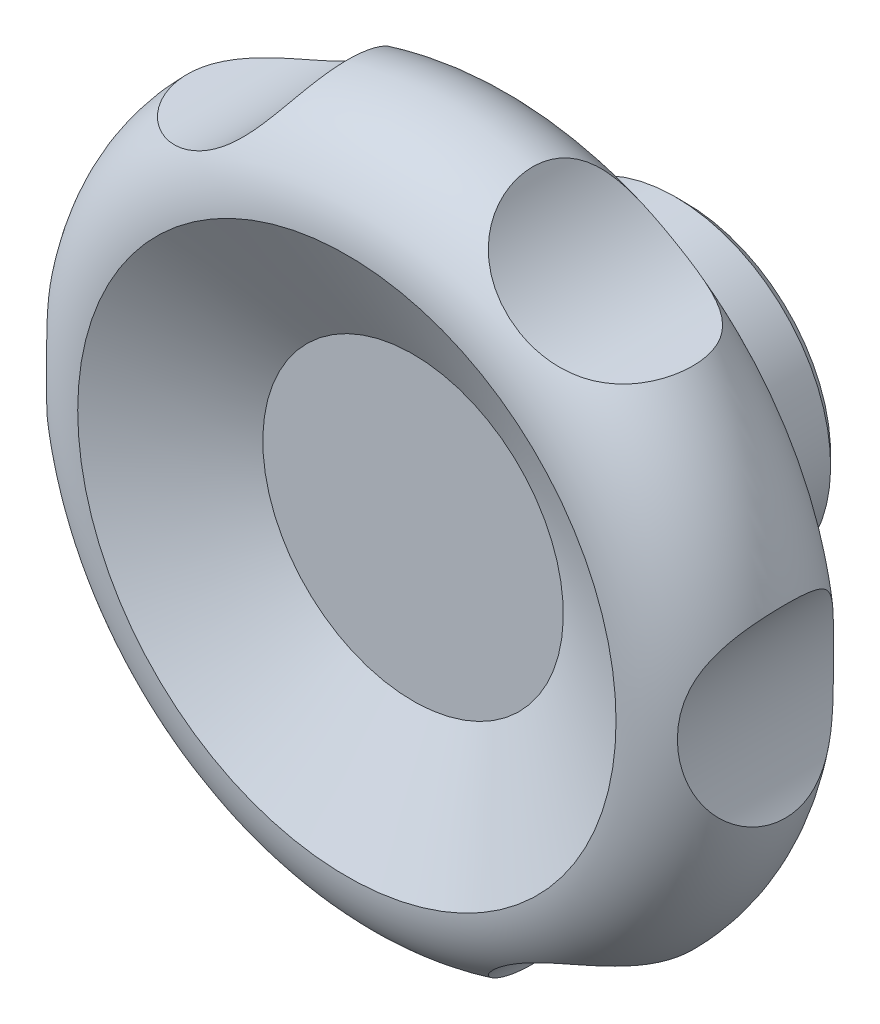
ISO-10303-21;
HEADER;
FILE_DESCRIPTION(('STEP AP214'),'2;1');
FILE_NAME('part.step','',(''),(''),'','','');
FILE_SCHEMA(('AUTOMOTIVE_DESIGN { 1 0 10303 214 1 1 1 1 }'));
ENDSEC;
DATA;
#1=APPLICATION_CONTEXT('core data for automotive mechanical design processes');
#2=APPLICATION_PROTOCOL_DEFINITION('international standard','automotive_design',2000,#1);
#3=PRODUCT_CONTEXT('',#1,'mechanical');
#4=PRODUCT('Part','Part','',(#3));
#5=PRODUCT_RELATED_PRODUCT_CATEGORY('part','',(#4));
#6=PRODUCT_DEFINITION_FORMATION('','',#4);
#7=PRODUCT_DEFINITION_CONTEXT('part definition',#1,'design');
#8=PRODUCT_DEFINITION('design','',#6,#7);
#9=PRODUCT_DEFINITION_SHAPE('','',#8);
#10=(LENGTH_UNIT() NAMED_UNIT(*) SI_UNIT(.MILLI.,.METRE.));
#11=(NAMED_UNIT(*) PLANE_ANGLE_UNIT() SI_UNIT($,.RADIAN.));
#12=(NAMED_UNIT(*) SI_UNIT($,.STERADIAN.) SOLID_ANGLE_UNIT());
#13=UNCERTAINTY_MEASURE_WITH_UNIT(LENGTH_MEASURE(1.E-05),#10,'distance_accuracy_value','');
#14=(GEOMETRIC_REPRESENTATION_CONTEXT(3) GLOBAL_UNCERTAINTY_ASSIGNED_CONTEXT((#13)) GLOBAL_UNIT_ASSIGNED_CONTEXT((#10,
#11,#12)) REPRESENTATION_CONTEXT('',''));
#15=CARTESIAN_POINT('',(0.,0.,0.));
#16=DIRECTION('',(0.,0.,1.));
#17=DIRECTION('',(1.,0.,0.));
#18=AXIS2_PLACEMENT_3D('',#15,#16,#17);
#19=CARTESIAN_POINT('',(0.,0.,23.7));
#20=DIRECTION('',(0.,0.,-1.));
#21=DIRECTION('',(0.499999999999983,0.866025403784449,0.));
#22=AXIS2_PLACEMENT_3D('',#19,#20,#21);
#23=TOROIDAL_SURFACE('',#22,25.4999999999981,9.);
#24=CARTESIAN_POINT('',(0.,0.,32.6873374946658));
#25=DIRECTION('',(0.,0.,-1.));
#26=DIRECTION('',(0.499999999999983,0.866025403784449,0.));
#27=AXIS2_PLACEMENT_3D('',#24,#25,#26);
#28=CIRCLE('',#27,25.9772470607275);
#29=CARTESIAN_POINT('',(12.9886235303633,22.496955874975,32.6873374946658));
#30=VERTEX_POINT('',#29);
#31=EDGE_CURVE('E16',#30,#30,#28,.F.);
#32=ORIENTED_EDGE('',*,*,#31,.F.);
#33=EDGE_LOOP('',(#32));
#34=FACE_BOUND('',#33,.T.);
#35=CARTESIAN_POINT('',(-31.7525207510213,6.19423952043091,17.8636520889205));
#36=CARTESIAN_POINT('',(-31.8192007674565,6.34386668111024,17.9741077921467));
#37=CARTESIAN_POINT('',(-31.8866191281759,6.48863914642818,18.0907182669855));
#38=CARTESIAN_POINT('',(-32.0215262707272,6.7674515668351,18.33611594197));
#39=CARTESIAN_POINT('',(-32.0890150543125,6.90149124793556,18.4649034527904));
#40=CARTESIAN_POINT('',(-32.2226100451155,7.15798141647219,18.7342898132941));
#41=CARTESIAN_POINT('',(-32.2887158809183,7.28042882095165,18.8748917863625));
#42=CARTESIAN_POINT('',(-32.4180473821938,7.51295992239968,19.1672109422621));
#43=CARTESIAN_POINT('',(-32.4812730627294,7.62304368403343,19.3189280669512));
#44=CARTESIAN_POINT('',(-32.6035068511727,7.83043866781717,19.6328005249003));
#45=CARTESIAN_POINT('',(-32.6625088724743,7.9277316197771,19.7949703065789));
#46=CARTESIAN_POINT('',(-32.7748756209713,8.10897842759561,20.1284626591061));
#47=CARTESIAN_POINT('',(-32.8282402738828,8.19293210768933,20.2997853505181));
#48=CARTESIAN_POINT('',(-32.9281665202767,8.34727867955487,20.6503692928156));
#49=CARTESIAN_POINT('',(-32.9747271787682,8.41766970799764,20.8296316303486));
#50=CARTESIAN_POINT('',(-33.0600414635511,8.54476626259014,21.1947415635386));
#51=CARTESIAN_POINT('',(-33.0987951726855,8.60147193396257,21.3805890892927));
#52=CARTESIAN_POINT('',(-33.1669353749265,8.70007466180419,21.7533369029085));
#53=CARTESIAN_POINT('',(-33.1965090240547,8.74226979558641,21.9401242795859));
#54=CARTESIAN_POINT('',(-33.246851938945,8.81356119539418,22.3173459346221));
#55=CARTESIAN_POINT('',(-33.2676213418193,8.8426576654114,22.5077801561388));
#56=CARTESIAN_POINT('',(-33.2999658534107,8.88778350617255,22.8909698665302));
#57=CARTESIAN_POINT('',(-33.3115405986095,8.90381236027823,23.0837254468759));
#58=CARTESIAN_POINT('',(-33.3252803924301,8.92282476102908,23.4702132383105));
#59=CARTESIAN_POINT('',(-33.3274453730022,8.92580821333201,23.6639454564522));
#60=CARTESIAN_POINT('',(-33.3222971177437,8.91869534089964,24.0531805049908));
#61=CARTESIAN_POINT('',(-33.3148792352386,8.9084546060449,24.2486793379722));
#62=CARTESIAN_POINT('',(-33.2905235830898,8.87462686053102,24.6379229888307));
#63=CARTESIAN_POINT('',(-33.2735857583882,8.85103977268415,24.8316677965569));
#64=CARTESIAN_POINT('',(-33.2305142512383,8.79049016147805,25.2160131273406));
#65=CARTESIAN_POINT('',(-33.2043809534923,8.75352819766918,25.4066137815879));
#66=CARTESIAN_POINT('',(-33.1434275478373,8.66620238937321,25.7833032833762));
#67=CARTESIAN_POINT('',(-33.1086074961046,8.61583863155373,25.9693921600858));
#68=CARTESIAN_POINT('',(-33.0310071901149,8.50175679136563,26.3355636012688));
#69=CARTESIAN_POINT('',(-32.9882330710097,8.43804899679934,26.5156506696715));
#70=CARTESIAN_POINT('',(-32.8955879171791,8.29732312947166,26.8686566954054));
#71=CARTESIAN_POINT('',(-32.8457169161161,8.22030511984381,27.0415756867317));
#72=CARTESIAN_POINT('',(-32.7399493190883,8.05314809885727,27.3789620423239));
#73=CARTESIAN_POINT('',(-32.6840543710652,7.96301267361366,27.5434316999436));
#74=CARTESIAN_POINT('',(-32.5674405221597,7.76990548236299,27.8628452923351));
#75=CARTESIAN_POINT('',(-32.5067216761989,7.66693386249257,28.0177893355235));
#76=CARTESIAN_POINT('',(-32.3824568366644,7.44976844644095,28.3156053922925));
#77=CARTESIAN_POINT('',(-32.3189475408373,7.33570487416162,28.4585877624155));
#78=CARTESIAN_POINT('',(-32.1898831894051,7.09606968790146,28.7335502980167));
#79=CARTESIAN_POINT('',(-32.124328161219,6.97049822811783,28.8655306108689));
#80=CARTESIAN_POINT('',(-31.9925618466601,6.70860947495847,29.1179871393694));
#81=CARTESIAN_POINT('',(-31.9263505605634,6.57229218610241,29.2384633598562));
#82=CARTESIAN_POINT('',(-31.7946220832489,6.28979397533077,29.4676680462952));
#83=CARTESIAN_POINT('',(-31.7291049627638,6.14361205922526,29.5763953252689));
#84=CARTESIAN_POINT('',(-31.5975680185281,5.83660466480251,29.7860247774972));
#85=CARTESIAN_POINT('',(-31.531625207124,5.67543264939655,29.8864671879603));
#86=CARTESIAN_POINT('',(-31.4031484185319,5.34468985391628,30.0749033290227));
#87=CARTESIAN_POINT('',(-31.3406145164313,5.17511888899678,30.1628967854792));
#88=CARTESIAN_POINT('',(-31.2200422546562,4.82868347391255,30.3269118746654));
#89=CARTESIAN_POINT('',(-31.1620054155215,4.65181658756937,30.4029294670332));
#90=CARTESIAN_POINT('',(-31.0513670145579,4.29195134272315,30.5435578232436));
#91=CARTESIAN_POINT('',(-30.9987660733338,4.10895228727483,30.6081672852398));
#92=CARTESIAN_POINT('',(-30.8924898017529,3.71067947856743,30.7353311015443));
#93=CARTESIAN_POINT('',(-30.8397869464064,3.49460645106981,30.7961963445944));
#94=CARTESIAN_POINT('',(-30.7433705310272,3.05723857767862,30.904843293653));
#95=CARTESIAN_POINT('',(-30.6996576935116,2.83594331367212,30.9526239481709));
#96=CARTESIAN_POINT('',(-30.6218167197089,2.38929627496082,31.0360875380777));
#97=CARTESIAN_POINT('',(-30.5876941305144,2.16394223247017,31.0717634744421));
#98=CARTESIAN_POINT('',(-30.5294890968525,1.71045044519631,31.1317893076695));
#99=CARTESIAN_POINT('',(-30.5054073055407,1.48231252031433,31.1561384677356));
#100=CARTESIAN_POINT('',(-30.4636735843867,0.977284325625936,31.1980119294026));
#101=CARTESIAN_POINT('',(-30.4483547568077,0.699995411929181,31.2131108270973));
#102=CARTESIAN_POINT('',(-30.4329338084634,0.144568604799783,31.2283099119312));
#103=CARTESIAN_POINT('',(-30.4328335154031,-0.133569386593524,31.2284082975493));
#104=CARTESIAN_POINT('',(-30.4478639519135,-0.689426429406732,31.2135950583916));
#105=CARTESIAN_POINT('',(-30.4630156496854,-0.967144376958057,31.1986627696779));
#106=CARTESIAN_POINT('',(-30.5083541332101,-1.52007634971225,31.1531906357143));
#107=CARTESIAN_POINT('',(-30.5385412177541,-1.79529032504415,31.1226504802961));
#108=CARTESIAN_POINT('',(-30.616803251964,-2.36572123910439,31.0414041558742));
#109=CARTESIAN_POINT('',(-30.6662322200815,-2.66053589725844,30.9891438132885));
#110=CARTESIAN_POINT('',(-30.7812591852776,-3.24234073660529,30.8628191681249));
#111=CARTESIAN_POINT('',(-30.8468599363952,-3.52932957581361,30.7887511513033));
#112=CARTESIAN_POINT('',(-30.9922808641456,-4.09152383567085,30.6167031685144));
#113=CARTESIAN_POINT('',(-31.0720635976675,-4.36675797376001,30.5187859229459));
#114=CARTESIAN_POINT('',(-31.24338539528,-4.9025235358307,30.2966652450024));
#115=CARTESIAN_POINT('',(-31.334917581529,-5.16306343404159,30.172477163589));
#116=CARTESIAN_POINT('',(-31.4955952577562,-5.58513873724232,29.9403309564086));
#117=CARTESIAN_POINT('',(-31.5625357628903,-5.75168409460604,29.8398888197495));
#118=CARTESIAN_POINT('',(-31.6988697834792,-6.0749481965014,29.6257616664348));
#119=CARTESIAN_POINT('',(-31.7682626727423,-6.23166942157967,29.5120800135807));
#120=CARTESIAN_POINT('',(-31.9079787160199,-6.53404956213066,29.2714800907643));
#121=CARTESIAN_POINT('',(-31.9783014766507,-6.67971299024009,29.1445672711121));
#122=CARTESIAN_POINT('',(-32.1182905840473,-6.95897742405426,28.8777395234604));
#123=CARTESIAN_POINT('',(-32.187956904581,-7.09257794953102,28.7378240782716));
#124=CARTESIAN_POINT('',(-32.3252011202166,-7.34722824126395,28.4450892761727));
#125=CARTESIAN_POINT('',(-32.3927709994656,-7.46823321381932,28.2922271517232));
#126=CARTESIAN_POINT('',(-32.5239173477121,-7.69643902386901,27.9749158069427));
#127=CARTESIAN_POINT('',(-32.5874937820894,-7.80363974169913,27.8104664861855));
#128=CARTESIAN_POINT('',(-32.7091134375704,-8.00374108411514,27.4710949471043));
#129=CARTESIAN_POINT('',(-32.7671553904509,-8.09663843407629,27.2961703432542));
#130=CARTESIAN_POINT('',(-32.8762929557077,-8.26777725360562,26.9372265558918));
#131=CARTESIAN_POINT('',(-32.9273888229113,-8.346019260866,26.753207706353));
#132=CARTESIAN_POINT('',(-33.0187052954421,-8.48356357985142,26.3884744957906));
#133=CARTESIAN_POINT('',(-33.0593853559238,-8.54370233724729,26.2081896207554));
#134=CARTESIAN_POINT('',(-33.132706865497,-8.65078765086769,25.8421512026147));
#135=CARTESIAN_POINT('',(-33.1653484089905,-8.69773436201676,25.6563977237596));
#136=CARTESIAN_POINT('',(-33.2219519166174,-8.77843835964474,25.2807620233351));
#137=CARTESIAN_POINT('',(-33.2459143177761,-8.81219631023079,25.0908800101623));
#138=CARTESIAN_POINT('',(-33.2847055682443,-8.86655574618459,24.7083185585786));
#139=CARTESIAN_POINT('',(-33.2995342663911,-8.88715701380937,24.5156390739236));
#140=CARTESIAN_POINT('',(-33.3198194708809,-8.91528489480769,24.1280785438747));
#141=CARTESIAN_POINT('',(-33.3252391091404,-8.92276007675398,23.9331918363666));
#142=CARTESIAN_POINT('',(-33.326491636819,-8.92449019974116,23.5433293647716));
#143=CARTESIAN_POINT('',(-33.3223245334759,-8.91874515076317,23.3483536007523));
#144=CARTESIAN_POINT('',(-33.3044810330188,-8.89402496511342,22.9596733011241));
#145=CARTESIAN_POINT('',(-33.2908043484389,-8.87504942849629,22.7659688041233));
#146=CARTESIAN_POINT('',(-33.2541988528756,-8.82384105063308,22.3812030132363));
#147=CARTESIAN_POINT('',(-33.2312700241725,-8.79160818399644,22.1901417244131));
#148=CARTESIAN_POINT('',(-33.176434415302,-8.71362010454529,21.8108818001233));
#149=CARTESIAN_POINT('',(-33.1444742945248,-8.66778446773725,21.6227073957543));
#150=CARTESIAN_POINT('',(-33.0722701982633,-8.5626544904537,21.2517835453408));
#151=CARTESIAN_POINT('',(-33.0320262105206,-8.50336013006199,21.0690341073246));
#152=CARTESIAN_POINT('',(-32.9440890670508,-8.37136954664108,20.7103401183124));
#153=CARTESIAN_POINT('',(-32.8963976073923,-8.2986763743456,20.5343940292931));
#154=CARTESIAN_POINT('',(-32.7945657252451,-8.14000964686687,20.1905417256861));
#155=CARTESIAN_POINT('',(-32.7404254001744,-8.05403629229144,20.0226353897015));
#156=CARTESIAN_POINT('',(-32.6275121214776,-7.87011149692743,19.6978889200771));
#157=CARTESIAN_POINT('',(-32.5687986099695,-7.77230681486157,19.5409449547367));
#158=CARTESIAN_POINT('',(-32.4474800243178,-7.56435761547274,19.237061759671));
#159=CARTESIAN_POINT('',(-32.3848750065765,-7.4542132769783,19.090122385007));
#160=CARTESIAN_POINT('',(-32.2571372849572,-7.22215270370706,18.8070766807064));
#161=CARTESIAN_POINT('',(-32.192004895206,-7.10023792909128,18.6709690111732));
#162=CARTESIAN_POINT('',(-32.0606014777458,-6.84533970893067,18.4101545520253));
#163=CARTESIAN_POINT('',(-31.994330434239,-6.71235610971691,18.2854479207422));
#164=CARTESIAN_POINT('',(-31.8611584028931,-6.43435420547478,18.0462097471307));
#165=CARTESIAN_POINT('',(-31.7942606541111,-6.28920015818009,17.9318343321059));
#166=CARTESIAN_POINT('',(-31.6620818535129,-5.9894172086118,17.7152356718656));
#167=CARTESIAN_POINT('',(-31.5968008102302,-5.83478825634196,17.6130124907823));
#168=CARTESIAN_POINT('',(-31.4690844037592,-5.5170869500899,17.4205409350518));
#169=CARTESIAN_POINT('',(-31.4066497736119,-5.35401244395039,17.3302956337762));
#170=CARTESIAN_POINT('',(-31.2857300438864,-5.02052971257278,17.1614413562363));
#171=CARTESIAN_POINT('',(-31.2272454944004,-4.85012047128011,17.0828339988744));
#172=CARTESIAN_POINT('',(-31.1090853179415,-4.48423614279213,16.9288375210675));
#173=CARTESIAN_POINT('',(-31.0499673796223,-4.28804588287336,16.8547201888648));
#174=CARTESIAN_POINT('',(-30.9387544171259,-3.88935608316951,16.7193369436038));
#175=CARTESIAN_POINT('',(-30.8866598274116,-3.68685615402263,16.6580718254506));
#176=CARTESIAN_POINT('',(-30.7902617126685,-3.27672349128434,16.5474928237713));
#177=CARTESIAN_POINT('',(-30.7459613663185,-3.06908870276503,16.498183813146));
#178=CARTESIAN_POINT('',(-30.6657592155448,-2.64988533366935,16.4107028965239));
#179=CARTESIAN_POINT('',(-30.6298583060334,-2.43831633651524,16.3725321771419));
#180=CARTESIAN_POINT('',(-30.5605594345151,-1.96950613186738,16.299967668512));
#181=CARTESIAN_POINT('',(-30.5291091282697,-1.71161877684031,16.2678685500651));
#182=CARTESIAN_POINT('',(-30.4794017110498,-1.19321951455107,16.2176606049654));
#183=CARTESIAN_POINT('',(-30.4611460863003,-0.932707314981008,16.1995533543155));
#184=CARTESIAN_POINT('',(-30.438060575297,-0.410130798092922,16.1767184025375));
#185=CARTESIAN_POINT('',(-30.4332499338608,-0.148064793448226,16.1720098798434));
#186=CARTESIAN_POINT('',(-30.437170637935,0.375869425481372,16.1758679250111));
#187=CARTESIAN_POINT('',(-30.4459024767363,0.637737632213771,16.1844349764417));
#188=CARTESIAN_POINT('',(-30.4791160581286,1.1990254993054,16.2174302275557));
#189=CARTESIAN_POINT('',(-30.5057608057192,1.49819524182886,16.2440417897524));
#190=CARTESIAN_POINT('',(-30.576335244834,2.0922535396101,16.3163409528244));
#191=CARTESIAN_POINT('',(-30.620268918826,2.38714109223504,16.3620329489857));
#192=CARTESIAN_POINT('',(-30.7243825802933,2.96938982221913,16.4741613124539));
#193=CARTESIAN_POINT('',(-30.7845278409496,3.25676566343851,16.540553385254));
#194=CARTESIAN_POINT('',(-30.919604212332,3.82158558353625,16.6963051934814));
#195=CARTESIAN_POINT('',(-30.9945267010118,4.09903534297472,16.785651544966));
#196=CARTESIAN_POINT('',(-31.1248676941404,4.53384502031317,16.9493606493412));
#197=CARTESIAN_POINT('',(-31.1763343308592,4.69543576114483,17.0157490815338));
#198=CARTESIAN_POINT('',(-31.2831937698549,5.01292204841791,17.1582408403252));
#199=CARTESIAN_POINT('',(-31.3385857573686,5.16881876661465,17.2343421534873));
#200=CARTESIAN_POINT('',(-31.4525128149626,5.47404062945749,17.3966215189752));
#201=CARTESIAN_POINT('',(-31.5110471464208,5.62336730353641,17.4827972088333));
#202=CARTESIAN_POINT('',(-31.6303530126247,5.91457968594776,17.6654619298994));
#203=CARTESIAN_POINT('',(-31.6911238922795,6.05646754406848,17.7619479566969));
#204=CARTESIAN_POINT('',(-31.7525207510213,6.19423952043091,17.8636520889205));
#205=B_SPLINE_CURVE_WITH_KNOTS('',3,(#35,#36,#37,#38,#39,#40,#41,#42,#43,#44,#45,#46,#47,#48,
#49,#50,#51,#52,#53,#54,#55,#56,#57,#58,#59,#60,#61,#62,#63,#64,#65,#66,#67,#68,#69,#70,#71,#72,
#73,#74,#75,#76,#77,#78,#79,#80,#81,#82,#83,#84,#85,#86,#87,#88,#89,#90,#91,#92,#93,#94,#95,#96,
#97,#98,#99,#100,#101,#102,#103,#104,#105,#106,#107,#108,#109,#110,#111,#112,#113,#114,#115,
#116,#117,#118,#119,#120,#121,#122,#123,#124,#125,#126,#127,#128,#129,#130,#131,#132,#133,#134,
#135,#136,#137,#138,#139,#140,#141,#142,#143,#144,#145,#146,#147,#148,#149,#150,#151,#152,#153,
#154,#155,#156,#157,#158,#159,#160,#161,#162,#163,#164,#165,#166,#167,#168,#169,#170,#171,#172,
#173,#174,#175,#176,#177,#178,#179,#180,#181,#182,#183,#184,#185,#186,#187,#188,#189,#190,#191,
#192,#193,#194,#195,#196,#197,#198,#199,#200,#201,#202,#203,#204),.UNSPECIFIED.,.T.,.F.,(4,2,2,
2,2,2,2,2,2,2,2,2,2,2,2,2,2,2,2,2,2,2,2,2,2,2,2,2,2,2,2,2,2,2,2,2,2,2,2,2,2,2,2,2,2,2,2,2,2,2,2,
2,2,2,2,2,2,2,2,2,2,2,2,2,2,2,2,2,2,2,2,2,2,2,2,2,2,2,2,2,2,2,2,2,4),(0.,0.592573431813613,
1.18516198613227,1.77790769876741,2.37065031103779,2.96423059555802,3.55781870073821,
4.15148829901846,4.74515159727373,5.32576715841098,5.90637367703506,6.48700314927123,
7.06763682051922,7.654665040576,8.24169665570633,8.82870371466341,9.41570697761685,
10.0022593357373,10.5888089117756,11.1751984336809,11.7615812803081,12.341761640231,
12.9219342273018,13.5021065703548,14.082337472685,14.6848116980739,15.2872991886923,
15.8899895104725,16.4927485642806,17.1838512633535,17.8750094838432,18.5665666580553,
19.2581688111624,20.0916742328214,20.9252797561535,21.7600328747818,22.5948025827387,
23.5039408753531,24.4132341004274,25.3201613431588,26.2265600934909,26.8430156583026,
27.4593149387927,28.075361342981,28.6914322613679,29.3096242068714,29.9278215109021,
30.5461601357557,31.1644760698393,31.7468575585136,32.3292322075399,32.9115775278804,
33.4939324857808,34.0785642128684,34.6631954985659,35.2478444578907,35.8324945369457,
36.4206725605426,37.0088514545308,37.5968965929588,38.1849328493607,38.7663062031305,
39.3476711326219,39.9289640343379,40.5102650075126,41.0992429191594,41.6882239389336,
42.2773557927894,42.8665695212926,43.5196322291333,44.1727353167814,44.8261041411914,
45.4795425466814,46.2640954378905,47.0487366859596,47.8345004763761,48.6202928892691,
49.5237738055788,50.4274629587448,51.3292314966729,52.2304754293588,52.7764977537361,
53.32240707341,53.868188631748,54.4138115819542),.UNSPECIFIED.);
#206=CARTESIAN_POINT('',(-31.7525207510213,6.19423952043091,17.8636520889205));
#207=VERTEX_POINT('',#206);
#208=EDGE_CURVE('E79',#207,#207,#205,.T.);
#209=ORIENTED_EDGE('',*,*,#208,.T.);
#210=EDGE_LOOP('',(#209));
#211=FACE_BOUND('',#210,.T.);
#212=CARTESIAN_POINT('',(10.3998526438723,30.7519989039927,17.9975892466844));
#213=CARTESIAN_POINT('',(10.5142193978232,30.590210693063,17.8551863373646));
#214=CARTESIAN_POINT('',(10.635637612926,30.4251720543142,17.7221566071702));
#215=CARTESIAN_POINT('',(10.8921393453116,30.0916779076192,17.4746728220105));
#216=CARTESIAN_POINT('',(11.0272304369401,29.9232205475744,17.3602291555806));
#217=CARTESIAN_POINT('',(11.3106160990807,29.5854850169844,17.1491166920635));
#218=CARTESIAN_POINT('',(11.4589413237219,29.4162058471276,17.0524908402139));
#219=CARTESIAN_POINT('',(11.7676005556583,29.0797982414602,16.8763464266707));
#220=CARTESIAN_POINT('',(11.9279332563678,28.9126695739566,16.7968260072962));
#221=CARTESIAN_POINT('',(12.2581036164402,28.5842111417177,16.6543332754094));
#222=CARTESIAN_POINT('',(12.4278389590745,28.4228418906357,16.5912138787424));
#223=CARTESIAN_POINT('',(12.777198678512,28.1059630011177,16.4793531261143));
#224=CARTESIAN_POINT('',(12.9568231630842,27.9504534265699,16.4306119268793));
#225=CARTESIAN_POINT('',(13.325001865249,27.6466488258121,16.3464068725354));
#226=CARTESIAN_POINT('',(13.5135550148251,27.4983529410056,16.3109414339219));
#227=CARTESIAN_POINT('',(13.8987077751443,27.2100043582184,16.2523745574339));
#228=CARTESIAN_POINT('',(14.0953078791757,27.0699521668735,16.2292738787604));
#229=CARTESIAN_POINT('',(14.5263304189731,26.7781730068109,16.1921559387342));
#230=CARTESIAN_POINT('',(14.7619350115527,26.6279416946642,16.1800709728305));
#231=CARTESIAN_POINT('',(15.2412994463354,26.3405616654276,16.1710205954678));
#232=CARTESIAN_POINT('',(15.485060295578,26.2034145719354,16.1740570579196));
#233=CARTESIAN_POINT('',(15.9793427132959,25.9429621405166,16.1953763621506));
#234=CARTESIAN_POINT('',(16.2298667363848,25.819661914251,16.2136648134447));
#235=CARTESIAN_POINT('',(16.7359166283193,25.5876006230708,16.2661867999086));
#236=CARTESIAN_POINT('',(16.9914418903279,25.4788378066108,16.3004184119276));
#237=CARTESIAN_POINT('',(17.4811269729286,25.2859286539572,16.3819696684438));
#238=CARTESIAN_POINT('',(17.715010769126,25.2004253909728,16.4277372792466));
#239=CARTESIAN_POINT('',(18.1835618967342,25.0419069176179,16.5345180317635));
#240=CARTESIAN_POINT('',(18.418229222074,24.9688916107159,16.5955310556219));
#241=CARTESIAN_POINT('',(18.8859450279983,24.8354900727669,16.7340594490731));
#242=CARTESIAN_POINT('',(19.1189952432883,24.7750872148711,16.811552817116));
#243=CARTESIAN_POINT('',(19.5813012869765,24.6666230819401,16.9844467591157));
#244=CARTESIAN_POINT('',(19.8105578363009,24.6185594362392,17.0798438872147));
#245=CARTESIAN_POINT('',(20.2241073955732,24.5414390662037,17.2719160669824));
#246=CARTESIAN_POINT('',(20.4094340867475,24.5105414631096,17.3656326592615));
#247=CARTESIAN_POINT('',(20.7736997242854,24.4564678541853,17.5666938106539));
#248=CARTESIAN_POINT('',(20.9526398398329,24.4332904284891,17.6740358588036));
#249=CARTESIAN_POINT('',(21.3022234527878,24.3940224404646,17.9025514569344));
#250=CARTESIAN_POINT('',(21.4728692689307,24.3779298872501,18.0237211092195));
#251=CARTESIAN_POINT('',(21.804026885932,24.3520052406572,18.2798287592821));
#252=CARTESIAN_POINT('',(21.9645385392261,24.3421732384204,18.4147669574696));
#253=CARTESIAN_POINT('',(22.2742654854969,24.3277668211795,18.6985804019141));
#254=CARTESIAN_POINT('',(22.4234297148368,24.3232149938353,18.847512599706));
#255=CARTESIAN_POINT('',(22.7080253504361,24.3183442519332,19.1580442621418));
#256=CARTESIAN_POINT('',(22.8434565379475,24.3180254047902,19.3196439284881));
#257=CARTESIAN_POINT('',(23.0991512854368,24.3204646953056,19.6544406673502));
#258=CARTESIAN_POINT('',(23.2194129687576,24.3232232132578,19.8276391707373));
#259=CARTESIAN_POINT('',(23.4435611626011,24.3306710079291,20.1842809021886));
#260=CARTESIAN_POINT('',(23.5474485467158,24.3353601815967,20.3677235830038));
#261=CARTESIAN_POINT('',(23.730821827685,24.3452144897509,20.7293159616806));
#262=CARTESIAN_POINT('',(23.811550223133,24.3503179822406,20.9068388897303));
#263=CARTESIAN_POINT('',(23.9576699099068,24.3605064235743,21.2680918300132));
#264=CARTESIAN_POINT('',(24.023061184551,24.3655913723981,21.4518218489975));
#265=CARTESIAN_POINT('',(24.1381119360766,24.3751081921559,21.8241427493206));
#266=CARTESIAN_POINT('',(24.1877724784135,24.3795401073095,22.0127333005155));
#267=CARTESIAN_POINT('',(24.2711080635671,24.3872580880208,22.3934387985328));
#268=CARTESIAN_POINT('',(24.3047828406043,24.390544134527,22.5855538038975));
#269=CARTESIAN_POINT('',(24.3559441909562,24.3956264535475,22.9716322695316));
#270=CARTESIAN_POINT('',(24.3734565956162,24.3974251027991,23.1655922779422));
#271=CARTESIAN_POINT('',(24.3923083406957,24.399363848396,23.5543009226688));
#272=CARTESIAN_POINT('',(24.393647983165,24.3995039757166,23.7490495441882));
#273=CARTESIAN_POINT('',(24.3801488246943,24.3981120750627,24.137988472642));
#274=CARTESIAN_POINT('',(24.3653092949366,24.3965799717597,24.3321787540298));
#275=CARTESIAN_POINT('',(24.3195158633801,24.3919941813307,24.7186334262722));
#276=CARTESIAN_POINT('',(24.2885618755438,24.3889404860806,24.9108978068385));
#277=CARTESIAN_POINT('',(24.2103625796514,24.3815930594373,25.2937161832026));
#278=CARTESIAN_POINT('',(24.1629850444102,24.37728931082,25.4842430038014));
#279=CARTESIAN_POINT('',(24.052243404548,24.3679302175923,25.8605760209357));
#280=CARTESIAN_POINT('',(23.9888792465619,24.3628748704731,26.0463822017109));
#281=CARTESIAN_POINT('',(23.8465513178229,24.3526388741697,26.4118779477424));
#282=CARTESIAN_POINT('',(23.7675905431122,24.3474582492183,26.5915686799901));
#283=CARTESIAN_POINT('',(23.5945887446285,24.3377229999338,26.9435542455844));
#284=CARTESIAN_POINT('',(23.500547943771,24.333168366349,27.1158491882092));
#285=CARTESIAN_POINT('',(23.2991248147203,24.3255759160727,27.4500961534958));
#286=CARTESIAN_POINT('',(23.1918882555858,24.3225231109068,27.6121357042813));
#287=CARTESIAN_POINT('',(22.9642093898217,24.3187533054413,27.9266789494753));
#288=CARTESIAN_POINT('',(22.8437672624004,24.3180362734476,28.0791827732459));
#289=CARTESIAN_POINT('',(22.5907674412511,24.3198462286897,28.3737118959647));
#290=CARTESIAN_POINT('',(22.4582118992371,24.3223726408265,28.5157390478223));
#291=CARTESIAN_POINT('',(22.182211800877,24.3315533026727,28.7886330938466));
#292=CARTESIAN_POINT('',(22.0387671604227,24.3382075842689,28.9194999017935));
#293=CARTESIAN_POINT('',(21.7415370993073,24.3565153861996,29.1703060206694));
#294=CARTESIAN_POINT('',(21.5876977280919,24.368196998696,29.2901792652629));
#295=CARTESIAN_POINT('',(21.2718489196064,24.3973009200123,29.5179793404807));
#296=CARTESIAN_POINT('',(21.1098361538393,24.414725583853,29.6259012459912));
#297=CARTESIAN_POINT('',(20.7791971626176,24.455923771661,29.8297928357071));
#298=CARTESIAN_POINT('',(20.6105695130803,24.4796986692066,29.9257599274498));
#299=CARTESIAN_POINT('',(20.2682895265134,24.5340539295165,30.1059412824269));
#300=CARTESIAN_POINT('',(20.094638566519,24.564632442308,30.1901587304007));
#301=CARTESIAN_POINT('',(19.7272415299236,24.6361326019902,30.3546667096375));
#302=CARTESIAN_POINT('',(19.5331366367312,24.6777547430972,30.4338506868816));
#303=CARTESIAN_POINT('',(19.1422579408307,24.7698091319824,30.5794436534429));
#304=CARTESIAN_POINT('',(18.945483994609,24.8202418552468,30.6458519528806));
#305=CARTESIAN_POINT('',(18.5506962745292,24.930053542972,30.7667332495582));
#306=CARTESIAN_POINT('',(18.3526820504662,24.9894359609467,30.8212016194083));
#307=CARTESIAN_POINT('',(17.9567778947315,25.1171328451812,30.9189970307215));
#308=CARTESIAN_POINT('',(17.7588879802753,25.1854483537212,30.9623227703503));
#309=CARTESIAN_POINT('',(17.3260730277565,25.3450366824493,31.0459923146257));
#310=CARTESIAN_POINT('',(17.0914123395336,25.4381919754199,31.0841263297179));
#311=CARTESIAN_POINT('',(16.6254954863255,25.6368134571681,31.146663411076));
#312=CARTESIAN_POINT('',(16.3942396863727,25.7422809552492,31.1710650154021));
#313=CARTESIAN_POINT('',(15.9362287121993,25.9652476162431,31.2069014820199));
#314=CARTESIAN_POINT('',(15.7094793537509,26.0827612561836,31.2183205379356));
#315=CARTESIAN_POINT('',(15.2619694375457,26.3291884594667,31.2285032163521));
#316=CARTESIAN_POINT('',(15.0412091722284,26.458102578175,31.227266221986));
#317=CARTESIAN_POINT('',(14.5703670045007,26.7491950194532,31.2108313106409));
#318=CARTESIAN_POINT('',(14.3215666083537,26.913328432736,31.1933298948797));
#319=CARTESIAN_POINT('',(13.8352505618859,27.2549758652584,31.1402722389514));
#320=CARTESIAN_POINT('',(13.5977370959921,27.4324924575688,31.1047125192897));
#321=CARTESIAN_POINT('',(13.1359590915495,27.7989428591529,31.0141418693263));
#322=CARTESIAN_POINT('',(12.9116806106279,27.9878642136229,30.9591518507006));
#323=CARTESIAN_POINT('',(12.4778828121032,28.3749376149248,30.8277548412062));
#324=CARTESIAN_POINT('',(12.2683581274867,28.5730862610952,30.7513556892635));
#325=CARTESIAN_POINT('',(11.9156269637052,28.9257223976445,30.5967553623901));
#326=CARTESIAN_POINT('',(11.7688363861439,29.0788855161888,30.5236747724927));
#327=CARTESIAN_POINT('',(11.4853529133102,29.387026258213,30.363201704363));
#328=CARTESIAN_POINT('',(11.3486576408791,29.54200344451,30.2758126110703));
#329=CARTESIAN_POINT('',(11.0861443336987,29.8517340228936,30.0859966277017));
#330=CARTESIAN_POINT('',(10.9603176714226,30.0064874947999,29.9835818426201));
#331=CARTESIAN_POINT('',(10.7200105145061,30.3136918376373,29.7631162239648));
#332=CARTESIAN_POINT('',(10.6055301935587,30.4661426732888,29.6450651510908));
#333=CARTESIAN_POINT('',(10.3875729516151,30.7674103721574,29.3922257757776));
#334=CARTESIAN_POINT('',(10.2841814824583,30.9161930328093,29.2573227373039));
#335=CARTESIAN_POINT('',(10.0895938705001,31.2064021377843,28.9716980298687));
#336=CARTESIAN_POINT('',(9.99839791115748,31.3478284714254,28.8209761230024));
#337=CARTESIAN_POINT('',(9.828207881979,31.6207682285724,28.5044347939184));
#338=CARTESIAN_POINT('',(9.7492128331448,31.7522824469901,28.3386165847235));
#339=CARTESIAN_POINT('',(9.60318480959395,32.0030221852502,27.9930188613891));
#340=CARTESIAN_POINT('',(9.53615057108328,32.1222490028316,27.8132408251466));
#341=CARTESIAN_POINT('',(9.42075002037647,32.333259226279,27.4629100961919));
#342=CARTESIAN_POINT('',(9.37111889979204,32.426621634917,27.2937205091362));
#343=CARTESIAN_POINT('',(9.28047331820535,32.6008887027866,26.9468299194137));
#344=CARTESIAN_POINT('',(9.23945860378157,32.6817937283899,26.769129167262));
#345=CARTESIAN_POINT('',(9.16564153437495,32.8301191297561,26.4065654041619));
#346=CARTESIAN_POINT('',(9.13283835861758,32.8975408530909,26.2217031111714));
#347=CARTESIAN_POINT('',(9.07503842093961,33.0181125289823,25.8461928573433));
#348=CARTESIAN_POINT('',(9.05004171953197,33.0712623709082,25.6555448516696));
#349=CARTESIAN_POINT('',(9.00809654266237,33.1614218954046,25.2752692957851));
#350=CARTESIAN_POINT('',(8.9909436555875,33.1988391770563,25.0857607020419));
#351=CARTESIAN_POINT('',(8.96343464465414,33.2592440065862,24.7039751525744));
#352=CARTESIAN_POINT('',(8.95307836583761,33.2822318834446,24.5116982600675));
#353=CARTESIAN_POINT('',(8.93900096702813,33.3135548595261,24.1257128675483));
#354=CARTESIAN_POINT('',(8.93527990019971,33.3218898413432,23.9320043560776));
#355=CARTESIAN_POINT('',(8.93441330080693,33.3238274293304,23.5444968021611));
#356=CARTESIAN_POINT('',(8.9372678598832,33.3174298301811,23.3506977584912));
#357=CARTESIAN_POINT('',(8.94966966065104,33.2898040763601,22.9621260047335));
#358=CARTESIAN_POINT('',(8.95929361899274,33.2684059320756,22.767367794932));
#359=CARTESIAN_POINT('',(8.98547066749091,33.2108093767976,22.38052124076));
#360=CARTESIAN_POINT('',(9.00202381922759,33.174610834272,22.1884329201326));
#361=CARTESIAN_POINT('',(9.04231064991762,33.0877824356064,21.8082978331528));
#362=CARTESIAN_POINT('',(9.06604481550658,33.0371516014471,21.620251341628));
#363=CARTESIAN_POINT('',(9.12101914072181,32.9220063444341,21.2495872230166));
#364=CARTESIAN_POINT('',(9.15225911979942,32.8574922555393,21.0669694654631));
#365=CARTESIAN_POINT('',(9.2224852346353,32.7155886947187,20.7091865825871));
#366=CARTESIAN_POINT('',(9.26144102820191,32.6382498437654,20.5339954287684));
#367=CARTESIAN_POINT('',(9.34756166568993,32.4714447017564,20.1915735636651));
#368=CARTESIAN_POINT('',(9.39472694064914,32.381977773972,20.024343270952));
#369=CARTESIAN_POINT('',(9.49757789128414,32.1921392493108,19.6991758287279));
#370=CARTESIAN_POINT('',(9.55325501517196,32.0917786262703,19.5412295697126));
#371=CARTESIAN_POINT('',(9.67344045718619,31.8814323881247,19.2355123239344));
#372=CARTESIAN_POINT('',(9.73794656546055,31.7714491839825,19.0877388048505));
#373=CARTESIAN_POINT('',(9.89201669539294,31.5168570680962,18.770161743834));
#374=CARTESIAN_POINT('',(9.983924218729,31.3701278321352,18.6031814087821));
#375=CARTESIAN_POINT('',(10.1815641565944,31.0673133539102,18.2869735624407));
#376=CARTESIAN_POINT('',(10.2872932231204,30.9112303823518,18.1377417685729));
#377=CARTESIAN_POINT('',(10.3998526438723,30.7519989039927,17.9975892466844));
#378=B_SPLINE_CURVE_WITH_KNOTS('',3,(#212,#213,#214,#215,#216,#217,#218,#219,#220,#221,#222,
#223,#224,#225,#226,#227,#228,#229,#230,#231,#232,#233,#234,#235,#236,#237,#238,#239,#240,#241,
#242,#243,#244,#245,#246,#247,#248,#249,#250,#251,#252,#253,#254,#255,#256,#257,#258,#259,#260,
#261,#262,#263,#264,#265,#266,#267,#268,#269,#270,#271,#272,#273,#274,#275,#276,#277,#278,#279,
#280,#281,#282,#283,#284,#285,#286,#287,#288,#289,#290,#291,#292,#293,#294,#295,#296,#297,#298,
#299,#300,#301,#302,#303,#304,#305,#306,#307,#308,#309,#310,#311,#312,#313,#314,#315,#316,#317,
#318,#319,#320,#321,#322,#323,#324,#325,#326,#327,#328,#329,#330,#331,#332,#333,#334,#335,#336,
#337,#338,#339,#340,#341,#342,#343,#344,#345,#346,#347,#348,#349,#350,#351,#352,#353,#354,#355,
#356,#357,#358,#359,#360,#361,#362,#363,#364,#365,#366,#367,#368,#369,#370,#371,#372,#373,#374,
#375,#376,#377),.UNSPECIFIED.,.T.,.F.,(4,2,2,2,2,2,2,2,2,2,2,2,2,2,2,2,2,2,2,2,2,2,2,2,2,2,2,2,
2,2,2,2,2,2,2,2,2,2,2,2,2,2,2,2,2,2,2,2,2,2,2,2,2,2,2,2,2,2,2,2,2,2,2,2,2,2,2,2,2,2,2,2,2,2,2,2,
2,2,2,2,2,2,4),(0.,0.731695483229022,1.46379854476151,2.1976437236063,2.9314091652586,
3.65834744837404,4.38529365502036,5.11215312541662,5.83905722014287,6.67725723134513,
7.51556111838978,8.35417346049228,9.19268467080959,9.95154885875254,10.7104071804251,
11.4682587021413,12.2259645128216,12.8552151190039,13.4843499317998,14.1133078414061,
14.7422749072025,15.3739227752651,16.0055807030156,16.6373166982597,17.2690189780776,
17.853575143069,18.4381319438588,19.0226491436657,19.6071760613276,20.1907671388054,
20.7743473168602,21.3579537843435,21.9415633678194,22.529985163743,23.1184089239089,
23.7067197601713,24.295021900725,24.8773271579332,25.4596245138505,26.0418186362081,
26.6240172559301,27.209512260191,27.7952476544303,28.381109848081,28.9668129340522,
29.6073725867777,30.2479668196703,30.8888088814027,31.5297257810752,32.295002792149,
33.0603612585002,33.8266505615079,34.5929772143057,35.4876494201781,36.3824940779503,
37.2763785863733,38.1699362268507,38.8424588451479,39.5148225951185,40.1866476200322,
40.8584829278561,41.5351709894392,42.2118692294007,42.8885131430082,43.5650855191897,
44.1628814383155,44.7606597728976,45.3583783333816,45.9561015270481,46.5372089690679,
47.1183031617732,47.699402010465,48.2805089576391,48.8683098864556,49.4561160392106,
50.0439620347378,50.6317938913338,51.2173584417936,51.8029537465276,52.3879645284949,
52.9728291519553,53.6931358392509,54.4132683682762),.UNSPECIFIED.);
#379=CARTESIAN_POINT('',(10.3998526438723,30.7519989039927,17.9975892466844));
#380=VERTEX_POINT('',#379);
#381=EDGE_CURVE('E67',#380,#380,#378,.T.);
#382=ORIENTED_EDGE('',*,*,#381,.T.);
#383=EDGE_LOOP('',(#382));
#384=FACE_BOUND('',#383,.T.);
#385=CARTESIAN_POINT('',(18.4856589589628,-24.9506880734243,16.6169228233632));
#386=CARTESIAN_POINT('',(18.2149770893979,-25.0312435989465,16.5413415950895));
#387=CARTESIAN_POINT('',(17.9437255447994,-25.1201901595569,16.4766043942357));
#388=CARTESIAN_POINT('',(17.40308817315,-25.3147362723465,16.3667916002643));
#389=CARTESIAN_POINT('',(17.1337037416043,-25.4203471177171,16.3217294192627));
#390=CARTESIAN_POINT('',(16.5985366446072,-25.6481268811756,16.2495435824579));
#391=CARTESIAN_POINT('',(16.3327685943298,-25.7703486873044,16.2224789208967));
#392=CARTESIAN_POINT('',(15.8078490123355,-26.0304218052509,16.1854279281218));
#393=CARTESIAN_POINT('',(15.5486962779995,-26.1682702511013,16.1754384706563));
#394=CARTESIAN_POINT('',(15.039383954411,-26.4584087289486,16.1721053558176));
#395=CARTESIAN_POINT('',(14.7892028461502,-26.6106605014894,16.1787187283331));
#396=CARTESIAN_POINT('',(14.2987142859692,-26.9288678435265,16.208785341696));
#397=CARTESIAN_POINT('',(14.0584077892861,-27.0948247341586,16.2322402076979));
#398=CARTESIAN_POINT('',(13.5896544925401,-27.4387676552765,16.296898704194));
#399=CARTESIAN_POINT('',(13.3611886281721,-27.6167332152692,16.3380727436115));
#400=CARTESIAN_POINT('',(12.9173122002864,-27.9831124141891,16.4397067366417));
#401=CARTESIAN_POINT('',(12.7018984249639,-28.1715234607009,16.5001619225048));
#402=CARTESIAN_POINT('',(12.3276846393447,-28.5176042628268,16.6279911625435));
#403=CARTESIAN_POINT('',(12.166220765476,-28.6738221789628,16.6915190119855));
#404=CARTESIAN_POINT('',(11.8535195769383,-28.9898012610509,16.8331987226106));
#405=CARTESIAN_POINT('',(11.7022800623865,-29.1495616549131,16.9113474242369));
#406=CARTESIAN_POINT('',(11.4109207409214,-29.4706598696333,17.0832596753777));
#407=CARTESIAN_POINT('',(11.2707947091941,-29.6319967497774,17.1770143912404));
#408=CARTESIAN_POINT('',(11.0023341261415,-29.9540959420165,17.3810227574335));
#409=CARTESIAN_POINT('',(10.8739996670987,-30.1148582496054,17.49127653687));
#410=CARTESIAN_POINT('',(10.628723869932,-30.4346105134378,17.7298256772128));
#411=CARTESIAN_POINT('',(10.5118885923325,-30.593573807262,17.8582663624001));
#412=CARTESIAN_POINT('',(10.2913085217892,-30.9054853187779,18.1325671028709));
#413=CARTESIAN_POINT('',(10.1875639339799,-31.0584334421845,18.2784274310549));
#414=CARTESIAN_POINT('',(9.99339061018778,-31.3553350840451,18.5870639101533));
#415=CARTESIAN_POINT('',(9.90295668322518,-31.4992920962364,18.7498334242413));
#416=CARTESIAN_POINT('',(9.73526384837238,-31.7754383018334,19.0913466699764));
#417=CARTESIAN_POINT('',(9.65800306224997,-31.9076291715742,19.27008811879));
#418=CARTESIAN_POINT('',(9.52606046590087,-32.1404285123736,19.6164110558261));
#419=CARTESIAN_POINT('',(9.46973432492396,-32.2428787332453,19.7821350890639));
#420=CARTESIAN_POINT('',(9.36624173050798,-32.4356952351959,20.1231944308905));
#421=CARTESIAN_POINT('',(9.31907482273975,-32.5260621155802,20.2985292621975));
#422=CARTESIAN_POINT('',(9.23349158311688,-32.6934893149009,20.6574690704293));
#423=CARTESIAN_POINT('',(9.19507454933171,-32.7705507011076,20.8410733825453));
#424=CARTESIAN_POINT('',(9.1265533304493,-32.9103997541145,21.2151423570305));
#425=CARTESIAN_POINT('',(9.09644914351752,-32.9731874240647,21.4056070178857));
#426=CARTESIAN_POINT('',(9.04530901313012,-33.0812896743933,21.7833509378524));
#427=CARTESIAN_POINT('',(9.02393082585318,-33.1272543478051,21.9703983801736));
#428=CARTESIAN_POINT('',(8.98810441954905,-33.2049834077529,22.3480684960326));
#429=CARTESIAN_POINT('',(8.97365600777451,-33.2367481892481,22.538691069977));
#430=CARTESIAN_POINT('',(8.95147183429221,-33.2857625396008,22.9221742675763));
#431=CARTESIAN_POINT('',(8.94373594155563,-33.3030123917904,23.1150348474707));
#432=CARTESIAN_POINT('',(8.93485404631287,-33.3228324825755,23.501662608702));
#433=CARTESIAN_POINT('',(8.93370816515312,-33.3254024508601,23.6954298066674));
#434=CARTESIAN_POINT('',(8.93801177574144,-33.3157844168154,24.0846654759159));
#435=CARTESIAN_POINT('',(8.94353415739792,-33.3034333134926,24.2801291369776));
#436=CARTESIAN_POINT('',(8.96138639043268,-33.2638201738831,24.6692274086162));
#437=CARTESIAN_POINT('',(8.97371627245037,-33.2365580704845,24.8628620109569));
#438=CARTESIAN_POINT('',(9.00537637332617,-33.1673969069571,25.2469154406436));
#439=CARTESIAN_POINT('',(9.02470643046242,-33.1254981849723,25.4373343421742));
#440=CARTESIAN_POINT('',(9.07064868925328,-33.0275008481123,25.8135852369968));
#441=CARTESIAN_POINT('',(9.0972608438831,-32.9714023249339,25.9994172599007));
#442=CARTESIAN_POINT('',(9.15808325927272,-32.8456876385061,26.3649478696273));
#443=CARTESIAN_POINT('',(9.19228544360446,-32.7760858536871,26.5446527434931));
#444=CARTESIAN_POINT('',(9.26868701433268,-32.6241336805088,26.8968274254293));
#445=CARTESIAN_POINT('',(9.31088636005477,-32.5417833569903,27.0692972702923));
#446=CARTESIAN_POINT('',(9.40365238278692,-32.3653678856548,27.4057229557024));
#447=CARTESIAN_POINT('',(9.45421671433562,-32.271306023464,27.5696811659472));
#448=CARTESIAN_POINT('',(9.56406403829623,-32.0726597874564,27.8880186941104));
#449=CARTESIAN_POINT('',(9.62334693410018,-31.9680755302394,28.0423981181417));
#450=CARTESIAN_POINT('',(9.75023234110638,-31.7509162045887,28.3390731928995));
#451=CARTESIAN_POINT('',(9.8177418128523,-31.6384356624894,28.4814779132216));
#452=CARTESIAN_POINT('',(9.96170944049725,-31.4060326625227,28.7552515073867));
#453=CARTESIAN_POINT('',(10.0381674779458,-31.286110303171,28.8866205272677));
#454=CARTESIAN_POINT('',(10.2000605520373,-31.0404107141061,29.1378350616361));
#455=CARTESIAN_POINT('',(10.2854956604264,-30.9146334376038,29.2576804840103));
#456=CARTESIAN_POINT('',(10.4652466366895,-30.6588356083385,29.4856165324));
#457=CARTESIAN_POINT('',(10.5595634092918,-30.5288146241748,29.5937059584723));
#458=CARTESIAN_POINT('',(10.7607478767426,-30.2609381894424,29.802162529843));
#459=CARTESIAN_POINT('',(10.8679642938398,-30.1229761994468,29.9020556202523));
#460=CARTESIAN_POINT('',(11.0913737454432,-29.8458886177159,30.0893834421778));
#461=CARTESIAN_POINT('',(11.2075669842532,-29.7067629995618,30.1768178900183));
#462=CARTESIAN_POINT('',(11.4485110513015,-29.428837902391,30.3397162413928));
#463=CARTESIAN_POINT('',(11.5732647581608,-29.2900385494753,30.4151760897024));
#464=CARTESIAN_POINT('',(11.8307889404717,-29.0141553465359,30.5546983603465));
#465=CARTESIAN_POINT('',(11.9635603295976,-28.877071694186,30.6187594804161));
#466=CARTESIAN_POINT('',(12.256789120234,-28.5857052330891,30.7448479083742));
#467=CARTESIAN_POINT('',(12.4184354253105,-28.4318804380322,30.8051702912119));
#468=CARTESIAN_POINT('',(12.7507464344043,-28.1294985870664,30.9127204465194));
#469=CARTESIAN_POINT('',(12.921411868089,-27.9809419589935,30.9599471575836));
#470=CARTESIAN_POINT('',(13.2710466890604,-27.6901883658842,31.0422923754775));
#471=CARTESIAN_POINT('',(13.4500208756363,-27.5479951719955,31.0774037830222));
#472=CARTESIAN_POINT('',(13.8153923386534,-27.2709957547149,31.1362852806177));
#473=CARTESIAN_POINT('',(14.0017900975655,-27.1361900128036,31.1600546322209));
#474=CARTESIAN_POINT('',(14.4201365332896,-26.8479163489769,31.2006178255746));
#475=CARTESIAN_POINT('',(14.6535920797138,-26.6962851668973,31.2149840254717));
#476=CARTESIAN_POINT('',(15.1288135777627,-26.4058810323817,31.2286647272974));
#477=CARTESIAN_POINT('',(15.3705805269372,-26.2671096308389,31.2279774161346));
#478=CARTESIAN_POINT('',(15.8613179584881,-26.0030684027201,31.2115082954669));
#479=CARTESIAN_POINT('',(16.1102978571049,-25.8778173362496,31.1957058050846));
#480=CARTESIAN_POINT('',(16.613535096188,-25.6416840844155,31.1483754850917));
#481=CARTESIAN_POINT('',(16.8677925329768,-25.5308021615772,31.1168473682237));
#482=CARTESIAN_POINT('',(17.4018250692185,-25.3149634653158,31.0334887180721));
#483=CARTESIAN_POINT('',(17.681908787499,-25.211343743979,30.9801409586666));
#484=CARTESIAN_POINT('',(18.2432107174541,-25.0220208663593,30.8515377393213));
#485=CARTESIAN_POINT('',(18.5244291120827,-24.9363207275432,30.7762785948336));
#486=CARTESIAN_POINT('',(19.083550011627,-24.7831064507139,30.6017445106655));
#487=CARTESIAN_POINT('',(19.3614593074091,-24.7155449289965,30.5025334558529));
#488=CARTESIAN_POINT('',(19.910174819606,-24.5979031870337,30.2777341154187));
#489=CARTESIAN_POINT('',(20.1809851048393,-24.547812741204,30.1521613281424));
#490=CARTESIAN_POINT('',(20.6253539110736,-24.477424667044,29.9177941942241));
#491=CARTESIAN_POINT('',(20.8022316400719,-24.4527247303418,29.8165481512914));
#492=CARTESIAN_POINT('',(21.1485985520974,-24.4102887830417,29.600851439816));
#493=CARTESIAN_POINT('',(21.3180895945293,-24.3925510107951,29.486404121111));
#494=CARTESIAN_POINT('',(21.6478646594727,-24.3633301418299,29.2443314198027));
#495=CARTESIAN_POINT('',(21.8081522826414,-24.3518445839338,29.1167112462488));
#496=CARTESIAN_POINT('',(22.1178736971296,-24.334249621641,28.8485496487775));
#497=CARTESIAN_POINT('',(22.2673070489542,-24.3281404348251,28.7080077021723));
#498=CARTESIAN_POINT('',(22.5541831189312,-24.3203023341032,28.4141315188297));
#499=CARTESIAN_POINT('',(22.691584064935,-24.3185881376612,28.260756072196));
#500=CARTESIAN_POINT('',(22.9524006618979,-24.3185172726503,27.9425336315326));
#501=CARTESIAN_POINT('',(23.0758161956,-24.3201606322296,27.7776865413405));
#502=CARTESIAN_POINT('',(23.3074857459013,-24.3257267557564,27.4376422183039));
#503=CARTESIAN_POINT('',(23.4157362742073,-24.3296500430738,27.2624426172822));
#504=CARTESIAN_POINT('',(23.6160827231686,-24.3387407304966,26.9030738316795));
#505=CARTESIAN_POINT('',(23.7081792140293,-24.3439080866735,26.7189049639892));
#506=CARTESIAN_POINT('',(23.87076090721,-24.3542468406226,26.3537070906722));
#507=CARTESIAN_POINT('',(23.9421738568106,-24.3594014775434,26.1730897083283));
#508=CARTESIAN_POINT('',(24.0695418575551,-24.369305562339,25.8064745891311));
#509=CARTESIAN_POINT('',(24.125497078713,-24.3740550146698,25.6204769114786));
#510=CARTESIAN_POINT('',(24.2216398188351,-24.3826017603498,25.244441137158));
#511=CARTESIAN_POINT('',(24.2618281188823,-24.3863991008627,25.0544032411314));
#512=CARTESIAN_POINT('',(24.3262448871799,-24.3926420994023,24.6716177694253));
#513=CARTESIAN_POINT('',(24.3504730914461,-24.3950877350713,24.47887014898));
#514=CARTESIAN_POINT('',(24.3829312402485,-24.3983906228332,24.0911542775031));
#515=CARTESIAN_POINT('',(24.3910894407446,-24.3992407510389,23.8961799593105));
#516=CARTESIAN_POINT('',(24.391156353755,-24.399247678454,23.5062288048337));
#517=CARTESIAN_POINT('',(24.383065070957,-24.398404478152,23.3112519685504));
#518=CARTESIAN_POINT('',(24.3506675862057,-24.3951072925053,22.9226553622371));
#519=CARTESIAN_POINT('',(24.3263607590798,-24.3926532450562,22.7290356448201));
#520=CARTESIAN_POINT('',(24.2616423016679,-24.3863811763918,22.3445277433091));
#521=CARTESIAN_POINT('',(24.2212306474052,-24.3825631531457,22.1536395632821));
#522=CARTESIAN_POINT('',(24.1242235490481,-24.3739440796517,21.7748674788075));
#523=CARTESIAN_POINT('',(24.0675362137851,-24.3691374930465,21.5870072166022));
#524=CARTESIAN_POINT('',(23.9383897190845,-24.359119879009,21.2167974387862));
#525=CARTESIAN_POINT('',(23.8659305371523,-24.3539088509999,21.0344479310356));
#526=CARTESIAN_POINT('',(23.7057214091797,-24.343784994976,20.676646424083));
#527=CARTESIAN_POINT('',(23.6179758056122,-24.3388720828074,20.501192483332));
#528=CARTESIAN_POINT('',(23.4278075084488,-24.330155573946,20.1584009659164));
#529=CARTESIAN_POINT('',(23.3253850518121,-24.3263519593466,19.9910632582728));
#530=CARTESIAN_POINT('',(23.1079412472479,-24.320778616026,19.6675452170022));
#531=CARTESIAN_POINT('',(22.9930785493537,-24.3189859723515,19.5112585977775));
#532=CARTESIAN_POINT('',(22.7507962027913,-24.3182564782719,19.2087413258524));
#533=CARTESIAN_POINT('',(22.6233766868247,-24.3193195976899,19.0625105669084));
#534=CARTESIAN_POINT('',(22.3571320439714,-24.3251971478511,18.7808851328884));
#535=CARTESIAN_POINT('',(22.2183055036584,-24.3300120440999,18.6454918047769));
#536=CARTESIAN_POINT('',(21.9305885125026,-24.344241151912,18.3861362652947));
#537=CARTESIAN_POINT('',(21.781698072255,-24.3536553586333,18.2621740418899));
#538=CARTESIAN_POINT('',(21.4730641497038,-24.3780205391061,18.0242898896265));
#539=CARTESIAN_POINT('',(21.3131943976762,-24.3930499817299,17.9105400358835));
#540=CARTESIAN_POINT('',(20.9861245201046,-24.4293023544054,17.6952106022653));
#541=CARTESIAN_POINT('',(20.8189237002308,-24.4505258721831,17.5936321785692));
#542=CARTESIAN_POINT('',(20.4788589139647,-24.499686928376,17.4025446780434));
#543=CARTESIAN_POINT('',(20.3059982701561,-24.5276205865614,17.3130286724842));
#544=CARTESIAN_POINT('',(19.9560481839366,-24.5905938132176,17.1456428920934));
#545=CARTESIAN_POINT('',(19.7789595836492,-24.6256319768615,17.0677708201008));
#546=CARTESIAN_POINT('',(19.4167579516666,-24.7041943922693,16.9210477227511));
#547=CARTESIAN_POINT('',(19.2315606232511,-24.747933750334,16.8525206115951));
#548=CARTESIAN_POINT('',(18.8595521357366,-24.843343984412,16.7265793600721));
#549=CARTESIAN_POINT('',(18.672741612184,-24.895011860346,16.6691610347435));
#550=CARTESIAN_POINT('',(18.4856589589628,-24.9506880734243,16.6169228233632));
#551=B_SPLINE_CURVE_WITH_KNOTS('',3,(#385,#386,#387,#388,#389,#390,#391,#392,#393,#394,#395,
#396,#397,#398,#399,#400,#401,#402,#403,#404,#405,#406,#407,#408,#409,#410,#411,#412,#413,#414,
#415,#416,#417,#418,#419,#420,#421,#422,#423,#424,#425,#426,#427,#428,#429,#430,#431,#432,#433,
#434,#435,#436,#437,#438,#439,#440,#441,#442,#443,#444,#445,#446,#447,#448,#449,#450,#451,#452,
#453,#454,#455,#456,#457,#458,#459,#460,#461,#462,#463,#464,#465,#466,#467,#468,#469,#470,#471,
#472,#473,#474,#475,#476,#477,#478,#479,#480,#481,#482,#483,#484,#485,#486,#487,#488,#489,#490,
#491,#492,#493,#494,#495,#496,#497,#498,#499,#500,#501,#502,#503,#504,#505,#506,#507,#508,#509,
#510,#511,#512,#513,#514,#515,#516,#517,#518,#519,#520,#521,#522,#523,#524,#525,#526,#527,#528,
#529,#530,#531,#532,#533,#534,#535,#536,#537,#538,#539,#540,#541,#542,#543,#544,#545,#546,#547,
#548,#549,#550),.UNSPECIFIED.,.T.,.F.,(4,2,2,2,2,2,2,2,2,2,2,2,2,2,2,2,2,2,2,2,2,2,2,2,2,2,2,2,
2,2,2,2,2,2,2,2,2,2,2,2,2,2,2,2,2,2,2,2,2,2,2,2,2,2,2,2,2,2,2,2,2,2,2,2,2,2,2,2,2,2,2,2,2,2,2,2,
2,2,2,2,2,2,4),(0.,0.876847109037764,1.75429101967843,2.63459711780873,3.51474202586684,
4.39261136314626,5.27056542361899,6.14705895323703,7.02333591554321,7.72311489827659,
8.42274283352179,9.1219760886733,9.82121481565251,10.5263943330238,11.2315848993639,
11.9364997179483,12.6413139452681,13.2489824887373,13.8566208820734,14.4642105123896,
15.0718000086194,15.6525112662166,16.2332063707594,16.8138901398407,17.3945846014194,
17.9816844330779,18.568786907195,19.1558758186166,19.742960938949,20.3294243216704,
20.9158847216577,21.5021809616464,22.0884707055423,22.6686566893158,23.2488349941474,
23.8290179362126,24.4092600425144,25.0124352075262,25.6156241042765,26.2190168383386,
26.8224784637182,27.5152732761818,28.208124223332,28.9013804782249,29.5946818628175,
30.4300584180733,31.2655355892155,32.1021575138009,32.9387947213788,33.847630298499,
34.7566187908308,35.6632090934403,36.5692678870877,37.1845522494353,37.7996808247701,
38.4145670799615,39.0294782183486,39.6464458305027,40.2634186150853,40.8805330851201,
41.4976257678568,42.0798138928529,42.6619956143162,43.2441484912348,43.8263109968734,
44.4110667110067,44.9958222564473,45.5806003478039,46.1653793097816,46.75352709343,
47.3416757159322,47.9296575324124,48.5176298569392,49.0988319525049,49.6800279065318,
50.261295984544,50.8425634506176,51.4322775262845,52.0220475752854,52.6114773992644,
53.2007907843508,53.8070553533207,54.413091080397),.UNSPECIFIED.);
#552=CARTESIAN_POINT('',(18.4856589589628,-24.9506880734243,16.6169228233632));
#553=VERTEX_POINT('',#552);
#554=EDGE_CURVE('E29',#553,#553,#551,.T.);
#555=ORIENTED_EDGE('',*,*,#554,.T.);
#556=EDGE_LOOP('',(#555));
#557=FACE_BOUND('',#556,.T.);
#558=CARTESIAN_POINT('',(0.,0.,14.7));
#559=DIRECTION('',(0.,0.,-1.));
#560=DIRECTION('',(0.499999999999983,0.866025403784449,0.));
#561=AXIS2_PLACEMENT_3D('',#558,#559,#560);
#562=CIRCLE('',#561,25.5);
#563=CARTESIAN_POINT('',(12.7499999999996,22.0836477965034,14.7));
#564=VERTEX_POINT('',#563);
#565=EDGE_CURVE('E123',#564,#564,#562,.T.);
#566=ORIENTED_EDGE('',*,*,#565,.F.);
#567=EDGE_LOOP('',(#566));
#568=FACE_BOUND('',#567,.T.);
#569=CARTESIAN_POINT('',(31.998298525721,6.71867903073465,18.2947387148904));
#570=CARTESIAN_POINT('',(31.9177445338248,6.55497174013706,18.1450022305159));
#571=CARTESIAN_POINT('',(31.8370026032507,6.38343249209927,18.0038884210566));
#572=CARTESIAN_POINT('',(31.6775385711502,6.0263415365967,17.7391685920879));
#573=CARTESIAN_POINT('',(31.598817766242,5.84078112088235,17.6155735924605));
#574=CARTESIAN_POINT('',(31.4454197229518,5.45709501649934,17.385429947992));
#575=CARTESIAN_POINT('',(31.3707535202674,5.25893793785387,17.2789264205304));
#576=CARTESIAN_POINT('',(31.2275680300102,4.852436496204,17.0826915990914));
#577=CARTESIAN_POINT('',(31.1590479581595,4.64409343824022,16.9929581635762));
#578=CARTESIAN_POINT('',(31.0302422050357,4.22096467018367,16.8300156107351));
#579=CARTESIAN_POINT('',(30.969887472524,4.00625453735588,16.7566639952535));
#580=CARTESIAN_POINT('',(30.8578216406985,3.57026189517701,16.6243721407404));
#581=CARTESIAN_POINT('',(30.806110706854,3.34897926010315,16.565432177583));
#582=CARTESIAN_POINT('',(30.7121945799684,2.90142059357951,16.4608975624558));
#583=CARTESIAN_POINT('',(30.6699855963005,2.67514659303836,16.4152975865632));
#584=CARTESIAN_POINT('',(30.595640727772,2.21883306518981,16.3364263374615));
#585=CARTESIAN_POINT('',(30.563505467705,1.9887933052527,16.3031558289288));
#586=CARTESIAN_POINT('',(30.5058231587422,1.49266727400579,16.2441620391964));
#587=CARTESIAN_POINT('',(30.48190041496,1.22617809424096,16.2202254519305));
#588=CARTESIAN_POINT('',(30.4481379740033,0.691411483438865,16.1866329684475));
#589=CARTESIAN_POINT('',(30.4382993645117,0.423133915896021,16.1769781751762));
#590=CARTESIAN_POINT('',(30.4328377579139,-0.11408786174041,16.1716045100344));
#591=CARTESIAN_POINT('',(30.4372348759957,-0.383032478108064,16.1759053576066));
#592=CARTESIAN_POINT('',(30.4602281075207,-0.919725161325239,16.198641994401));
#593=CARTESIAN_POINT('',(30.4788249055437,-1.18747316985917,16.2170784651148));
#594=CARTESIAN_POINT('',(30.5332253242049,-1.75424170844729,16.272025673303));
#595=CARTESIAN_POINT('',(30.5709220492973,-2.05289230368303,16.3105428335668));
#596=CARTESIAN_POINT('',(30.6633006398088,-2.64427709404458,16.4079645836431));
#597=CARTESIAN_POINT('',(30.7179857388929,-2.93701015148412,16.4668730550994));
#598=CARTESIAN_POINT('',(30.842918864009,-3.51306073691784,16.6070645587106));
#599=CARTESIAN_POINT('',(30.9131351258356,-3.79639614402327,16.6883020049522));
#600=CARTESIAN_POINT('',(31.0671981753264,-4.35087361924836,16.8755517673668));
#601=CARTESIAN_POINT('',(31.1510378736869,-4.62202193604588,16.9815512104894));
#602=CARTESIAN_POINT('',(31.3025828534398,-5.06912337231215,17.1844701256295));
#603=CARTESIAN_POINT('',(31.367543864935,-5.24915448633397,17.2745114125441));
#604=CARTESIAN_POINT('',(31.5014525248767,-5.60011408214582,17.468290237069));
#605=CARTESIAN_POINT('',(31.5703991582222,-5.7710448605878,17.57202429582));
#606=CARTESIAN_POINT('',(31.7107832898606,-6.10237273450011,17.7934527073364));
#607=CARTESIAN_POINT('',(31.7822192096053,-6.2627763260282,17.9111383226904));
#608=CARTESIAN_POINT('',(31.9259809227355,-6.57188296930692,18.1605394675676));
#609=CARTESIAN_POINT('',(31.9983067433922,-6.72058566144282,18.292255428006));
#610=CARTESIAN_POINT('',(32.142424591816,-7.00580462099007,18.5700448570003));
#611=CARTESIAN_POINT('',(32.2142123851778,-7.14225890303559,18.7161842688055));
#612=CARTESIAN_POINT('',(32.3550641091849,-7.40118686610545,19.0215887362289));
#613=CARTESIAN_POINT('',(32.4241280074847,-7.52366038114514,19.1808539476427));
#614=CARTESIAN_POINT('',(32.5577503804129,-7.75388719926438,19.5115092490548));
#615=CARTESIAN_POINT('',(32.6223080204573,-7.86163777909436,19.682901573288));
#616=CARTESIAN_POINT('',(32.7452328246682,-8.06186385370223,20.0364819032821));
#617=CARTESIAN_POINT('',(32.8036003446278,-8.15434022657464,20.2186692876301));
#618=CARTESIAN_POINT('',(32.9083454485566,-8.31699502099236,20.5775245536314));
#619=CARTESIAN_POINT('',(32.9553065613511,-8.38835949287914,20.7534864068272));
#620=CARTESIAN_POINT('',(33.0417513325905,-8.51776194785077,21.1120255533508));
#621=CARTESIAN_POINT('',(33.0812350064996,-8.57579995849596,21.2946028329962));
#622=CARTESIAN_POINT('',(33.1519184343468,-8.67850616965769,21.6650237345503));
#623=CARTESIAN_POINT('',(33.1831189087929,-8.723175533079,21.8528668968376));
#624=CARTESIAN_POINT('',(33.2366264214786,-8.79916529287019,22.232480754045));
#625=CARTESIAN_POINT('',(33.2589333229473,-8.83048548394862,22.4242515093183));
#626=CARTESIAN_POINT('',(33.294132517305,-8.87967856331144,22.8093441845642));
#627=CARTESIAN_POINT('',(33.3070729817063,-8.89762027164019,23.0026529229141));
#628=CARTESIAN_POINT('',(33.3234852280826,-8.92034754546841,23.3904381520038));
#629=CARTESIAN_POINT('',(33.3269571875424,-8.92513335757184,23.5849146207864));
#630=CARTESIAN_POINT('',(33.324368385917,-8.92155723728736,23.9736930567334));
#631=CARTESIAN_POINT('',(33.3183071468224,-8.91319464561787,24.1679950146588));
#632=CARTESIAN_POINT('',(33.2967636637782,-8.88330701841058,24.5550599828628));
#633=CARTESIAN_POINT('',(33.2812813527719,-8.86178188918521,24.7478229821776));
#634=CARTESIAN_POINT('',(33.2410001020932,-8.80527945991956,25.1322291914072));
#635=CARTESIAN_POINT('',(33.2161161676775,-8.7701793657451,25.3238454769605));
#636=CARTESIAN_POINT('',(33.1575326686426,-8.68651324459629,25.7027439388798));
#637=CARTESIAN_POINT('',(33.1238330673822,-8.63794716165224,25.890026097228));
#638=CARTESIAN_POINT('',(33.0482997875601,-8.52735615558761,26.2588552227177));
#639=CARTESIAN_POINT('',(33.0064675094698,-8.46533354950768,26.4404031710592));
#640=CARTESIAN_POINT('',(32.9155284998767,-8.32788179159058,26.7964648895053));
#641=CARTESIAN_POINT('',(32.8664218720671,-8.25245283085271,26.9709787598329));
#642=CARTESIAN_POINT('',(32.762464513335,-8.08910595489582,27.3101232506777));
#643=CARTESIAN_POINT('',(32.7076715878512,-8.00131099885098,27.4748308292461));
#644=CARTESIAN_POINT('',(32.5931417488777,-7.81298804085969,27.7949833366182));
#645=CARTESIAN_POINT('',(32.5334048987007,-7.71246020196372,27.9504283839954));
#646=CARTESIAN_POINT('',(32.4102958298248,-7.49911899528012,28.2510556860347));
#647=CARTESIAN_POINT('',(32.3469243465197,-7.38630810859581,28.3962400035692));
#648=CARTESIAN_POINT('',(32.217913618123,-7.14897538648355,28.675604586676));
#649=CARTESIAN_POINT('',(32.1522743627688,-7.02445349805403,28.8097848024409));
#650=CARTESIAN_POINT('',(32.0199887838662,-6.76415889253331,29.0668840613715));
#651=CARTESIAN_POINT('',(31.9533405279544,-6.62836151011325,29.1897771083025));
#652=CARTESIAN_POINT('',(31.8205465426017,-6.34659813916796,29.4237139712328));
#653=CARTESIAN_POINT('',(31.7544010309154,-6.20062799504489,29.5347528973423));
#654=CARTESIAN_POINT('',(31.6239404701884,-5.89953790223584,29.7449035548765));
#655=CARTESIAN_POINT('',(31.5596257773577,-5.74441619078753,29.8440129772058));
#656=CARTESIAN_POINT('',(31.4340481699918,-5.4261516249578,30.0304438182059));
#657=CARTESIAN_POINT('',(31.3727844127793,-5.26301101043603,30.1177685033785));
#658=CARTESIAN_POINT('',(31.2492474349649,-4.91543758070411,30.2880459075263));
#659=CARTESIAN_POINT('',(31.1873376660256,-4.73037821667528,30.3699825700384));
#660=CARTESIAN_POINT('',(31.0694249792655,-4.35332311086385,30.5211210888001));
#661=CARTESIAN_POINT('',(31.013422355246,-4.16132702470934,30.5903223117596));
#662=CARTESIAN_POINT('',(30.9081912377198,-3.77156405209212,30.7167912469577));
#663=CARTESIAN_POINT('',(30.8589652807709,-3.57379503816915,30.774054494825));
#664=CARTESIAN_POINT('',(30.7679914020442,-3.17366999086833,30.8774242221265));
#665=CARTESIAN_POINT('',(30.7262443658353,-2.97131341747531,30.9235293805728));
#666=CARTESIAN_POINT('',(30.6435919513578,-2.52435642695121,31.0130940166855));
#667=CARTESIAN_POINT('',(30.6043441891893,-2.2790153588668,31.0543977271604));
#668=CARTESIAN_POINT('',(30.5377591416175,-1.78482916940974,31.1233937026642));
#669=CARTESIAN_POINT('',(30.5104230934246,-1.53598368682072,31.1510845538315));
#670=CARTESIAN_POINT('',(30.4680057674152,-1.03587613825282,31.1936843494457));
#671=CARTESIAN_POINT('',(30.4529387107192,-0.784611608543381,31.2085784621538));
#672=CARTESIAN_POINT('',(30.4352977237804,-0.281217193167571,31.2259891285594));
#673=CARTESIAN_POINT('',(30.4327244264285,-0.0290872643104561,31.2285050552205));
#674=CARTESIAN_POINT('',(30.4407574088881,0.51915965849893,31.2206055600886));
#675=CARTESIAN_POINT('',(30.4537612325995,0.815214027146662,31.2078380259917));
#676=CARTESIAN_POINT('',(30.4968861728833,1.40485230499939,31.1647570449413));
#677=CARTESIAN_POINT('',(30.5270105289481,1.69843573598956,31.134440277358));
#678=CARTESIAN_POINT('',(30.6037923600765,2.28063592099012,31.0550482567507));
#679=CARTESIAN_POINT('',(30.6504358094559,2.56925667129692,31.0059889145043));
#680=CARTESIAN_POINT('',(30.7592788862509,3.13922277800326,30.887311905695));
#681=CARTESIAN_POINT('',(30.8214734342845,3.42057047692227,30.8177009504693));
#682=CARTESIAN_POINT('',(30.9439154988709,3.90950429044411,30.6744248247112));
#683=CARTESIAN_POINT('',(31.0013174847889,4.1191654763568,30.6053789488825));
#684=CARTESIAN_POINT('',(31.1233955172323,4.53096429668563,30.4528411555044));
#685=CARTESIAN_POINT('',(31.1880698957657,4.73310364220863,30.3693525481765));
#686=CARTESIAN_POINT('',(31.3233582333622,5.12811393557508,30.1870969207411));
#687=CARTESIAN_POINT('',(31.393967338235,5.32099225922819,30.0883423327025));
#688=CARTESIAN_POINT('',(31.5395781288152,5.69596802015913,29.8748292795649));
#689=CARTESIAN_POINT('',(31.614579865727,5.87806533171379,29.7600706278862));
#690=CARTESIAN_POINT('',(31.7676891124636,6.2311608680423,29.5132566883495));
#691=CARTESIAN_POINT('',(31.8458162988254,6.40206133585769,29.3810733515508));
#692=CARTESIAN_POINT('',(32.002457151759,6.7295732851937,29.1002170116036));
#693=CARTESIAN_POINT('',(32.0809708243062,6.886184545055,28.9515437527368));
#694=CARTESIAN_POINT('',(32.2360671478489,7.1836753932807,28.6383402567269));
#695=CARTESIAN_POINT('',(32.3126501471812,7.32455783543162,28.4738129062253));
#696=CARTESIAN_POINT('',(32.4615828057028,7.58949126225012,28.1299655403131));
#697=CARTESIAN_POINT('',(32.5339329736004,7.7135442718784,27.9506473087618));
#698=CARTESIAN_POINT('',(32.6635265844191,7.92955405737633,27.6020802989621));
#699=CARTESIAN_POINT('',(32.721526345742,8.02358505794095,27.434392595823));
#700=CARTESIAN_POINT('',(32.8312944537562,8.19784268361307,27.0900441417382));
#701=CARTESIAN_POINT('',(32.8830630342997,8.27806982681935,26.9133837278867));
#702=CARTESIAN_POINT('',(32.979205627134,8.42451897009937,26.552436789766));
#703=CARTESIAN_POINT('',(33.0235803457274,8.49074230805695,26.3681509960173));
#704=CARTESIAN_POINT('',(33.1039797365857,8.60911809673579,25.9933427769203));
#705=CARTESIAN_POINT('',(33.1400043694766,8.661270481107,25.8028203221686));
#706=CARTESIAN_POINT('',(33.2018600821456,8.74994131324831,25.4236542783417));
#707=CARTESIAN_POINT('',(33.2279996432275,8.7869365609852,25.2351721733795));
#708=CARTESIAN_POINT('',(33.2712895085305,8.84782837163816,24.855090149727));
#709=CARTESIAN_POINT('',(33.288440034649,8.87172525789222,24.6634903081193));
#710=CARTESIAN_POINT('',(33.3134313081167,8.90645030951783,24.2785130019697));
#711=CARTESIAN_POINT('',(33.3212722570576,8.91727875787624,24.0851355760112));
#712=CARTESIAN_POINT('',(33.3275006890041,8.92588516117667,23.6979363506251));
#713=CARTESIAN_POINT('',(33.3258880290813,8.92366291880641,23.5041145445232));
#714=CARTESIAN_POINT('',(33.3131659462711,8.90606367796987,23.1151599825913));
#715=CARTESIAN_POINT('',(33.3019483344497,8.89053681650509,22.920037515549));
#716=CARTESIAN_POINT('',(33.2700842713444,8.84610476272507,22.5320966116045));
#717=CARTESIAN_POINT('',(33.2494377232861,8.81719943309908,22.3392781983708));
#718=CARTESIAN_POINT('',(33.1991086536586,8.74597237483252,21.9572953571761));
#719=CARTESIAN_POINT('',(33.1694245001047,8.70364822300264,21.7681315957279));
#720=CARTESIAN_POINT('',(33.1016076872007,8.60556828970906,21.3948722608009));
#721=CARTESIAN_POINT('',(33.0634752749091,8.54981290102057,21.2107765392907));
#722=CARTESIAN_POINT('',(32.9796350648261,8.42504341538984,20.849423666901));
#723=CARTESIAN_POINT('',(32.9339454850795,8.35606114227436,20.6721513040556));
#724=CARTESIAN_POINT('',(32.8358742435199,8.20484882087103,20.3252539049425));
#725=CARTESIAN_POINT('',(32.7834920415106,8.12261770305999,20.1556294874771));
#726=CARTESIAN_POINT('',(32.6732352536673,7.94525005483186,19.8254678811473));
#727=CARTESIAN_POINT('',(32.6153683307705,7.85013145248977,19.6649184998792));
#728=CARTESIAN_POINT('',(32.4953617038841,7.64729560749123,19.3537687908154));
#729=CARTESIAN_POINT('',(32.4332235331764,7.53958287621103,19.2031649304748));
#730=CARTESIAN_POINT('',(32.3095397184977,7.31834878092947,18.9207597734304));
#731=CARTESIAN_POINT('',(32.2481512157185,7.20547770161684,18.788379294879));
#732=CARTESIAN_POINT('',(32.1239792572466,6.96955389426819,18.5338282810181));
#733=CARTESIAN_POINT('',(32.0611961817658,6.84650391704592,18.4116550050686));
#734=CARTESIAN_POINT('',(31.998298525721,6.71867903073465,18.2947387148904));
#735=B_SPLINE_CURVE_WITH_KNOTS('',3,(#569,#570,#571,#572,#573,#574,#575,#576,#577,#578,#579,
#580,#581,#582,#583,#584,#585,#586,#587,#588,#589,#590,#591,#592,#593,#594,#595,#596,#597,#598,
#599,#600,#601,#602,#603,#604,#605,#606,#607,#608,#609,#610,#611,#612,#613,#614,#615,#616,#617,
#618,#619,#620,#621,#622,#623,#624,#625,#626,#627,#628,#629,#630,#631,#632,#633,#634,#635,#636,
#637,#638,#639,#640,#641,#642,#643,#644,#645,#646,#647,#648,#649,#650,#651,#652,#653,#654,#655,
#656,#657,#658,#659,#660,#661,#662,#663,#664,#665,#666,#667,#668,#669,#670,#671,#672,#673,#674,
#675,#676,#677,#678,#679,#680,#681,#682,#683,#684,#685,#686,#687,#688,#689,#690,#691,#692,#693,
#694,#695,#696,#697,#698,#699,#700,#701,#702,#703,#704,#705,#706,#707,#708,#709,#710,#711,#712,
#713,#714,#715,#716,#717,#718,#719,#720,#721,#722,#723,#724,#725,#726,#727,#728,#729,#730,#731,
#732,#733,#734),.UNSPECIFIED.,.T.,.F.,(4,2,2,2,2,2,2,2,2,2,2,2,2,2,2,2,2,2,2,2,2,2,2,2,2,2,2,2,
2,2,2,2,2,2,2,2,2,2,2,2,2,2,2,2,2,2,2,2,2,2,2,2,2,2,2,2,2,2,2,2,2,2,2,2,2,2,2,2,2,2,2,2,2,2,2,2,
2,2,2,2,2,2,4),(0.,0.707869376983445,1.41618206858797,2.12633482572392,2.83639683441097,
3.54001836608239,4.2436533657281,4.94700716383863,5.65040457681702,6.45550122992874,
7.26066005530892,8.06695707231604,8.87329296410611,9.78253689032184,10.6919539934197,
11.5995280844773,12.50663139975,13.1405706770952,13.7743492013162,14.4077328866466,
15.0411360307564,15.6775825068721,16.3140365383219,16.9506081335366,17.5871431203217,
18.1732542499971,18.759364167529,19.3454230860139,19.9314910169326,20.514522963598,
21.0975439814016,21.6805942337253,22.2636486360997,22.8521053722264,23.4405645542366,
24.0289224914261,24.6172720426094,25.2001377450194,25.7829959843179,26.3657367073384,
26.9484800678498,27.5325335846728,28.1168271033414,28.7012335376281,29.2854776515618,
29.9197922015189,30.554138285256,31.1887211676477,31.8233791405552,32.578265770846,
33.3332307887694,34.0890696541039,34.8449468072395,35.7337632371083,36.6227479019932,
37.5109795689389,38.39892149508,39.0825283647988,39.7659787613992,40.4488754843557,
41.1317801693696,41.8200166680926,42.5082638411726,43.1963859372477,43.8844251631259,
44.4861059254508,45.0877641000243,45.6893647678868,46.2909682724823,46.8718412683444,
47.4526999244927,48.0335460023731,48.6144008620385,49.2018857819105,49.7893767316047,
50.3769738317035,50.9645537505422,51.5507373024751,52.1369681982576,52.7223917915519,
53.3076063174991,53.8604693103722,54.4131833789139),.UNSPECIFIED.);
#736=CARTESIAN_POINT('',(31.998298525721,6.71867903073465,18.2947387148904));
#737=VERTEX_POINT('',#736);
#738=EDGE_CURVE('E37',#737,#737,#735,.T.);
#739=ORIENTED_EDGE('',*,*,#738,.T.);
#740=EDGE_LOOP('',(#739));
#741=FACE_BOUND('',#740,.T.);
#742=CARTESIAN_POINT('',(-10.1806025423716,31.0706789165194,18.2947387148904));
#743=CARTESIAN_POINT('',(-10.0963798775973,31.1964848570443,18.418979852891));
#744=CARTESIAN_POINT('',(-10.0167805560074,31.319462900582,18.549147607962));
#745=CARTESIAN_POINT('',(-9.86674635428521,31.5582041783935,18.8209578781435));
#746=CARTESIAN_POINT('',(-9.79631244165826,31.673966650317,18.9626016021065));
#747=CARTESIAN_POINT('',(-9.66447883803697,31.8967138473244,19.2567136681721));
#748=CARTESIAN_POINT('',(-9.60308365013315,32.0036941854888,19.4091873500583));
#749=CARTESIAN_POINT('',(-9.48911943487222,32.2073759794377,19.7239806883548));
#750=CARTESIAN_POINT('',(-9.43655022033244,32.3040776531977,19.886300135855));
#751=CARTESIAN_POINT('',(-9.33988789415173,32.4859763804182,20.219758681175));
#752=CARTESIAN_POINT('',(-9.29579799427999,32.5711690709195,20.3909010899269));
#753=CARTESIAN_POINT('',(-9.21573737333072,32.7289472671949,20.7407320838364));
#754=CARTESIAN_POINT('',(-9.17976676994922,32.8015325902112,20.9194207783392));
#755=CARTESIAN_POINT('',(-9.11555343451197,32.9332451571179,21.283055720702));
#756=CARTESIAN_POINT('',(-9.08731144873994,32.9923711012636,21.4680025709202));
#757=CARTESIAN_POINT('',(-9.03819978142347,33.0964973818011,21.8427844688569));
#758=CARTESIAN_POINT('',(-9.0173300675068,33.1414977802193,22.0326194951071));
#759=CARTESIAN_POINT('',(-8.98284416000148,33.2165053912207,22.4138046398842));
#760=CARTESIAN_POINT('',(-8.96915473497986,33.2466637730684,22.605118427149));
#761=CARTESIAN_POINT('',(-8.94849443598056,33.2923837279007,22.9898393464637));
#762=CARTESIAN_POINT('',(-8.9415235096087,33.3079454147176,23.183246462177));
#763=CARTESIAN_POINT('',(-8.93418910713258,33.3243223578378,23.5708145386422));
#764=CARTESIAN_POINT('',(-8.9338258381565,33.3251371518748,23.7649755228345));
#765=CARTESIAN_POINT('',(-8.9397013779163,33.3120115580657,24.1526981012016));
#766=CARTESIAN_POINT('',(-8.94594019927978,33.2980711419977,24.3462596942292));
#767=CARTESIAN_POINT('',(-8.96522561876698,33.2553335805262,24.733568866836));
#768=CARTESIAN_POINT('',(-8.97834674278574,33.226373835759,24.9272948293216));
#769=CARTESIAN_POINT('',(-9.01164475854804,33.1537996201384,25.3113682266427));
#770=CARTESIAN_POINT('',(-9.03182169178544,33.110185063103,25.5017156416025));
#771=CARTESIAN_POINT('',(-9.07952087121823,33.0087664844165,25.877627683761));
#772=CARTESIAN_POINT('',(-9.10704223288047,32.9509641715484,26.0631928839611));
#773=CARTESIAN_POINT('',(-9.16978708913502,32.8218087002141,26.428204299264));
#774=CARTESIAN_POINT('',(-9.20501049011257,32.7504557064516,26.6076505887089));
#775=CARTESIAN_POINT('',(-9.28328912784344,32.5955483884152,26.9579560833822));
#776=CARTESIAN_POINT('',(-9.32629126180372,32.5120775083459,27.1288640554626));
#777=CARTESIAN_POINT('',(-9.42065594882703,32.3336116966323,27.4621397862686));
#778=CARTESIAN_POINT('',(-9.47201841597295,32.2386168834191,27.6245076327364));
#779=CARTESIAN_POINT('',(-9.58342317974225,32.038346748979,27.9395775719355));
#780=CARTESIAN_POINT('',(-9.64346333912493,31.9330739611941,28.0922820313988));
#781=CARTESIAN_POINT('',(-9.77248498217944,31.7136260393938,28.3871467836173));
#782=CARTESIAN_POINT('',(-9.84146644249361,31.5994509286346,28.5293071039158));
#783=CARTESIAN_POINT('',(-9.9881835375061,31.3642646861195,28.8017618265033));
#784=CARTESIAN_POINT('',(-10.0658787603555,31.2432863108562,28.932106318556));
#785=CARTESIAN_POINT('',(-10.2303161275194,30.9955898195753,29.1812257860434));
#786=CARTESIAN_POINT('',(-10.3170619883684,30.8688693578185,29.2999959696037));
#787=CARTESIAN_POINT('',(-10.4994662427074,30.6113539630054,29.5257074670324));
#788=CARTESIAN_POINT('',(-10.5951257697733,30.4805585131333,29.6326472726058));
#789=CARTESIAN_POINT('',(-10.7950746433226,30.2165476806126,29.8346826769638));
#790=CARTESIAN_POINT('',(-10.899361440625,30.0833330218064,29.9297817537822));
#791=CARTESIAN_POINT('',(-11.1235102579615,29.806996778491,30.1144029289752));
#792=CARTESIAN_POINT('',(-11.2439475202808,29.6638086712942,30.2031262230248));
#793=CARTESIAN_POINT('',(-11.4937809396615,29.3779979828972,30.3679367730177));
#794=CARTESIAN_POINT('',(-11.6231774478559,29.2353754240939,30.4440235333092));
#795=CARTESIAN_POINT('',(-11.8904082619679,28.9520953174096,30.5842547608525));
#796=CARTESIAN_POINT('',(-12.0282454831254,28.8114384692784,30.6483950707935));
#797=CARTESIAN_POINT('',(-12.3117351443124,28.5333606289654,30.765450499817));
#798=CARTESIAN_POINT('',(-12.4573885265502,28.3959400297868,30.8183642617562));
#799=CARTESIAN_POINT('',(-12.7821450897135,28.1015965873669,30.9220898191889));
#800=CARTESIAN_POINT('',(-12.9626290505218,27.9454893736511,30.9708988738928));
#801=CARTESIAN_POINT('',(-13.3326231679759,27.6405398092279,31.0551464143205));
#802=CARTESIAN_POINT('',(-13.5221341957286,27.491698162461,31.0905836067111));
#803=CARTESIAN_POINT('',(-13.9094516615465,27.2022047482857,31.1490272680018));
#804=CARTESIAN_POINT('',(-14.1072662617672,27.061561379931,31.1720211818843));
#805=CARTESIAN_POINT('',(-14.5101072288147,26.7894708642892,31.2061636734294));
#806=CARTESIAN_POINT('',(-14.7151339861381,26.6580242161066,31.2173116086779));
#807=CARTESIAN_POINT('',(-15.1715204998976,26.3806816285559,31.2291291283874));
#808=CARTESIAN_POINT('',(-15.424212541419,26.2368632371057,31.2273733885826));
#809=CARTESIAN_POINT('',(-15.9369559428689,25.9641638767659,31.2074277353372));
#810=CARTESIAN_POINT('',(-16.1970085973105,25.8352855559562,31.1892349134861));
#811=CARTESIAN_POINT('',(-16.7225074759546,25.5932410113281,31.1356722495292));
#812=CARTESIAN_POINT('',(-16.987951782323,25.4800693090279,31.1003084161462));
#813=CARTESIAN_POINT('',(-17.522102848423,25.2699333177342,31.0110571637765));
#814=CARTESIAN_POINT('',(-17.7908088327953,25.1729652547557,30.9571740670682));
#815=CARTESIAN_POINT('',(-18.2800661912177,25.0116011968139,30.840676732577));
#816=CARTESIAN_POINT('',(-18.5005225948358,24.9444868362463,30.7814126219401));
#817=CARTESIAN_POINT('',(-18.9400698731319,24.8213274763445,30.6481115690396));
#818=CARTESIAN_POINT('',(-19.1591608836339,24.7652813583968,30.5740761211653));
#819=CARTESIAN_POINT('',(-19.5937382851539,24.6641364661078,30.410168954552));
#820=CARTESIAN_POINT('',(-19.8092274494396,24.6190288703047,30.3203100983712));
#821=CARTESIAN_POINT('',(-20.2344151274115,24.5393101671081,30.1237294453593));
#822=CARTESIAN_POINT('',(-20.4441136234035,24.5046990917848,30.0170075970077));
#823=CARTESIAN_POINT('',(-20.8569901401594,24.4450337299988,29.7849489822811));
#824=CARTESIAN_POINT('',(-21.0600906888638,24.420070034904,29.6594504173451));
#825=CARTESIAN_POINT('',(-21.4549016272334,24.3791547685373,29.3903122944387));
#826=CARTESIAN_POINT('',(-21.6466118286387,24.3632033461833,29.2466724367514));
#827=CARTESIAN_POINT('',(-22.0157305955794,24.3390185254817,28.9416307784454));
#828=CARTESIAN_POINT('',(-22.1931462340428,24.3307812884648,28.7802378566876));
#829=CARTESIAN_POINT('',(-22.5311460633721,24.3204707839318,28.4405295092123));
#830=CARTESIAN_POINT('',(-22.6917329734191,24.3183965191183,28.2622168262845));
#831=CARTESIAN_POINT('',(-22.9715666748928,24.3187018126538,27.9175238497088));
#832=CARTESIAN_POINT('',(-23.0934192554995,24.3204707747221,27.7532501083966));
#833=CARTESIAN_POINT('',(-23.3220921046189,24.3262076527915,27.4145900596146));
#834=CARTESIAN_POINT('',(-23.428913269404,24.3301754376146,27.240204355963));
#835=CARTESIAN_POINT('',(-23.6265863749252,24.3392991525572,26.8826576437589));
#836=CARTESIAN_POINT('',(-23.7174395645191,24.3444549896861,26.6994973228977));
#837=CARTESIAN_POINT('',(-23.8824888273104,24.3550389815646,26.3258259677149));
#838=CARTESIAN_POINT('',(-23.9566849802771,24.3604671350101,26.1353149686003));
#839=CARTESIAN_POINT('',(-24.0844846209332,24.3705444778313,25.7585769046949));
#840=CARTESIAN_POINT('',(-24.1389614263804,24.3752195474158,25.5726460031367));
#841=CARTESIAN_POINT('',(-24.2322078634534,24.3835832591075,25.1968695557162));
#842=CARTESIAN_POINT('',(-24.2709779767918,24.3872719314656,25.0070241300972));
#843=CARTESIAN_POINT('',(-24.3326227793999,24.3932781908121,24.62475805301));
#844=CARTESIAN_POINT('',(-24.3554980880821,24.3955958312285,24.4323375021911));
#845=CARTESIAN_POINT('',(-24.3852543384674,24.3986311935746,24.0462482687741));
#846=CARTESIAN_POINT('',(-24.3921349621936,24.3993488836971,23.8525795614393));
#847=CARTESIAN_POINT('',(-24.3898593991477,24.3991135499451,23.4633312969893));
#848=CARTESIAN_POINT('',(-24.3805365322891,24.3981431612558,23.2677527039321));
#849=CARTESIAN_POINT('',(-24.3455730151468,24.3945937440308,22.8780732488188));
#850=CARTESIAN_POINT('',(-24.3199323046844,24.3920147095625,22.6839723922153));
#851=CARTESIAN_POINT('',(-24.2524513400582,24.3855100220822,22.2986293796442));
#852=CARTESIAN_POINT('',(-24.2106111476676,24.3815843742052,22.1073872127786));
#853=CARTESIAN_POINT('',(-24.1109417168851,24.3728089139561,21.7291365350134));
#854=CARTESIAN_POINT('',(-24.0531125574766,24.3679591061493,21.5421280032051));
#855=CARTESIAN_POINT('',(-23.9217718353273,24.3579063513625,21.1736506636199));
#856=CARTESIAN_POINT('',(-23.8482559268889,24.3527033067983,20.9921834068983));
#857=CARTESIAN_POINT('',(-23.6860188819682,24.3426516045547,20.6361670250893));
#858=CARTESIAN_POINT('',(-23.5972978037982,24.3378029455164,20.4616178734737));
#859=CARTESIAN_POINT('',(-23.405314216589,24.3292765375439,20.1207424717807));
#860=CARTESIAN_POINT('',(-23.3020557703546,24.3255984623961,19.9544139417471));
#861=CARTESIAN_POINT('',(-23.0818071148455,24.3203024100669,19.6310807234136));
#862=CARTESIAN_POINT('',(-22.964817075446,24.318684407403,19.4740759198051));
#863=CARTESIAN_POINT('',(-22.719500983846,24.3184368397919,19.1720733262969));
#864=CARTESIAN_POINT('',(-22.5913149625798,24.3197743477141,19.0269617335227));
#865=CARTESIAN_POINT('',(-22.3236973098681,24.326258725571,18.7476118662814));
#866=CARTESIAN_POINT('',(-22.1842658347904,24.3314055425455,18.6133734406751));
#867=CARTESIAN_POINT('',(-21.8954894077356,24.3463456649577,18.356322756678));
#868=CARTESIAN_POINT('',(-21.746144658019,24.35613887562,18.2335102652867));
#869=CARTESIAN_POINT('',(-21.4389641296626,24.3811214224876,17.9996025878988));
#870=CARTESIAN_POINT('',(-21.2811275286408,24.3963112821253,17.8885085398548));
#871=CARTESIAN_POINT('',(-20.9529666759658,24.4333412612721,17.6745236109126));
#872=CARTESIAN_POINT('',(-20.7824002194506,24.4553901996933,17.5720408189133));
#873=CARTESIAN_POINT('',(-20.4354273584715,24.5064892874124,17.379486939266));
#874=CARTESIAN_POINT('',(-20.2590208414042,24.5355395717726,17.2894160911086));
#875=CARTESIAN_POINT('',(-19.9018719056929,24.6010537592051,17.1212508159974));
#876=CARTESIAN_POINT('',(-19.7211280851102,24.6375200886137,17.0431603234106));
#877=CARTESIAN_POINT('',(-19.3567892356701,24.7181235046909,16.8984213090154));
#878=CARTESIAN_POINT('',(-19.1731938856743,24.7622614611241,16.8317740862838));
#879=CARTESIAN_POINT('',(-18.7784421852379,24.8651285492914,16.7006312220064));
#880=CARTESIAN_POINT('',(-18.5670515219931,24.9250376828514,16.6377654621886));
#881=CARTESIAN_POINT('',(-18.1439474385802,25.0550746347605,16.5250781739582));
#882=CARTESIAN_POINT('',(-17.9322339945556,25.125203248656,16.4752576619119));
#883=CARTESIAN_POINT('',(-17.5098094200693,25.2756322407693,16.387680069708));
#884=CARTESIAN_POINT('',(-17.299098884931,25.3559380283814,16.3499294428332));
#885=CARTESIAN_POINT('',(-16.8800073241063,25.5265063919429,16.2857035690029));
#886=CARTESIAN_POINT('',(-16.6716264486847,25.6167696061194,16.2592290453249));
#887=CARTESIAN_POINT('',(-16.2156942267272,25.8265695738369,16.212566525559));
#888=CARTESIAN_POINT('',(-15.9689041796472,25.9483083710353,16.1947924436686));
#889=CARTESIAN_POINT('',(-15.4818014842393,26.2052902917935,16.174053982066));
#890=CARTESIAN_POINT('',(-15.2414896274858,26.3405350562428,16.1710914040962));
#891=CARTESIAN_POINT('',(-14.768394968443,26.6239827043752,16.1798755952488));
#892=CARTESIAN_POINT('',(-14.5356244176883,26.7722053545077,16.1916451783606));
#893=CARTESIAN_POINT('',(-14.0793384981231,27.0804552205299,16.2303744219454));
#894=CARTESIAN_POINT('',(-13.8558232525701,27.2404825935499,16.2573342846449));
#895=CARTESIAN_POINT('',(-13.3976009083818,27.5875870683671,16.3308984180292));
#896=CARTESIAN_POINT('',(-13.1639966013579,27.7757707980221,16.3791919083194));
#897=CARTESIAN_POINT('',(-12.7113143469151,28.1627717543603,16.4972100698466));
#898=CARTESIAN_POINT('',(-12.4922397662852,28.3615914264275,16.566939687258));
#899=CARTESIAN_POINT('',(-12.0712320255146,28.7662171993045,16.7298687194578));
#900=CARTESIAN_POINT('',(-11.869244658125,28.9719980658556,16.8229898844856));
#901=CARTESIAN_POINT('',(-11.4836195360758,29.3871702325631,17.0350772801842));
#902=CARTESIAN_POINT('',(-11.299967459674,29.5965585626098,17.1540231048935));
#903=CARTESIAN_POINT('',(-10.9464185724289,30.0216626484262,17.4244162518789));
#904=CARTESIAN_POINT('',(-10.7772344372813,30.2373413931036,17.5768610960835));
#905=CARTESIAN_POINT('',(-10.4616320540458,30.661313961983,17.9127385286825));
#906=CARTESIAN_POINT('',(-10.3152122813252,30.8696082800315,18.0961690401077));
#907=CARTESIAN_POINT('',(-10.1806025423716,31.0706789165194,18.2947387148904));
#908=B_SPLINE_CURVE_WITH_KNOTS('',3,(#742,#743,#744,#745,#746,#747,#748,#749,#750,#751,#752,
#753,#754,#755,#756,#757,#758,#759,#760,#761,#762,#763,#764,#765,#766,#767,#768,#769,#770,#771,
#772,#773,#774,#775,#776,#777,#778,#779,#780,#781,#782,#783,#784,#785,#786,#787,#788,#789,#790,
#791,#792,#793,#794,#795,#796,#797,#798,#799,#800,#801,#802,#803,#804,#805,#806,#807,#808,#809,
#810,#811,#812,#813,#814,#815,#816,#817,#818,#819,#820,#821,#822,#823,#824,#825,#826,#827,#828,
#829,#830,#831,#832,#833,#834,#835,#836,#837,#838,#839,#840,#841,#842,#843,#844,#845,#846,#847,
#848,#849,#850,#851,#852,#853,#854,#855,#856,#857,#858,#859,#860,#861,#862,#863,#864,#865,#866,
#867,#868,#869,#870,#871,#872,#873,#874,#875,#876,#877,#878,#879,#880,#881,#882,#883,#884,#885,
#886,#887,#888,#889,#890,#891,#892,#893,#894,#895,#896,#897,#898,#899,#900,#901,#902,#903,#904,
#905,#906,#907),.UNSPECIFIED.,.T.,.F.,(4,2,2,2,2,2,2,2,2,2,2,2,2,2,2,2,2,2,2,2,2,2,2,2,2,2,2,2,
2,2,2,2,2,2,2,2,2,2,2,2,2,2,2,2,2,2,2,2,2,2,2,2,2,2,2,2,2,2,2,2,2,2,2,2,2,2,2,2,2,2,2,2,2,2,2,2,
2,2,2,2,2,2,4),(0.,0.587294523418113,1.17465099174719,1.76229909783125,2.34993473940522,
2.93779252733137,3.52565883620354,4.11358189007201,4.70150236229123,5.28330397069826,
5.86510104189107,6.44691635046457,7.02873277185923,7.61698365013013,8.2052379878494,
8.79342151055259,9.38159788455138,9.96590091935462,10.5501979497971,11.1343513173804,
11.7185031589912,12.3000499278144,12.8818364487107,13.4636970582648,14.0453863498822,
14.6659931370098,15.2866242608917,15.9074709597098,16.5283926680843,17.2584088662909,
17.9884956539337,18.7193177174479,19.450179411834,20.3214914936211,21.1929577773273,
22.0641193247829,22.9350776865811,23.648253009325,24.3613562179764,25.0738824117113,
25.7864107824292,26.5054761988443,27.224553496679,27.9432727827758,28.6618757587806,
29.2747119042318,29.8875114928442,30.5002631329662,31.1130118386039,31.6937486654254,
32.2744676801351,32.8551640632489,33.4358719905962,34.0225888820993,34.6093079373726,
35.1960247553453,35.7827386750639,36.3696153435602,36.9564897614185,37.5432004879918,
38.1299039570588,38.7101039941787,39.2902959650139,39.8704761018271,40.4507125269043,
41.0507048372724,41.6507087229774,42.2509092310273,42.8511778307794,43.536127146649,
44.2211298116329,44.9064981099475,45.5919103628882,46.4183347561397,47.2448596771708,
48.0726661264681,48.900483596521,49.8107564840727,50.7212395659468,51.628716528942,
52.5354790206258,53.4741914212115,54.4128409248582),.UNSPECIFIED.);
#909=CARTESIAN_POINT('',(-10.1806025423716,31.0706789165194,18.2947387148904));
#910=VERTEX_POINT('',#909);
#911=EDGE_CURVE('E73',#910,#910,#908,.T.);
#912=ORIENTED_EDGE('',*,*,#911,.T.);
#913=EDGE_LOOP('',(#912));
#914=FACE_BOUND('',#913,.T.);
#915=CARTESIAN_POINT('',(-21.4320859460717,-24.3825360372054,17.9975892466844));
#916=CARTESIAN_POINT('',(-21.5913286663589,-24.3678859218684,18.1125248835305));
#917=CARTESIAN_POINT('',(-21.7464311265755,-24.3561546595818,18.2335564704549));
#918=CARTESIAN_POINT('',(-22.0468238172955,-24.3377730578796,18.487576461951));
#919=CARTESIAN_POINT('',(-22.19211539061,-24.3311220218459,18.6205632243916));
#920=CARTESIAN_POINT('',(-22.471472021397,-24.322042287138,18.8980191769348));
#921=CARTESIAN_POINT('',(-22.6055357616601,-24.3196140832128,19.0424897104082));
#922=CARTESIAN_POINT('',(-22.8611287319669,-24.3180556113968,19.3421521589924));
#923=CARTESIAN_POINT('',(-22.9826576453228,-24.3189254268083,19.4973443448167));
#924=CARTESIAN_POINT('',(-23.212204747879,-24.3230176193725,19.8176653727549));
#925=CARTESIAN_POINT('',(-23.3202070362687,-24.3262427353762,19.9828055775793));
#926=CARTESIAN_POINT('',(-23.5216322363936,-24.3341217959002,20.3217188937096));
#927=CARTESIAN_POINT('',(-23.6150550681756,-24.3387757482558,20.4954920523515));
#928=CARTESIAN_POINT('',(-23.7866327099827,-24.3486545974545,20.8504386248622));
#929=CARTESIAN_POINT('',(-23.8647849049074,-24.3538795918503,21.0316132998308));
#930=CARTESIAN_POINT('',(-24.0052799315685,-24.3641449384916,21.3999948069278));
#931=CARTESIAN_POINT('',(-24.0676228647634,-24.369185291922,21.5872016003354));
#932=CARTESIAN_POINT('',(-24.1751601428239,-24.3783755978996,21.9628642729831));
#933=CARTESIAN_POINT('',(-24.2206416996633,-24.3825398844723,22.1512376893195));
#934=CARTESIAN_POINT('',(-24.2957737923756,-24.3896420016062,22.5311350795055));
#935=CARTESIAN_POINT('',(-24.3254245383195,-24.3925798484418,22.7226590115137));
#936=CARTESIAN_POINT('',(-24.3687596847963,-24.3969330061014,23.1075281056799));
#937=CARTESIAN_POINT('',(-24.3824434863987,-24.3983482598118,23.3008733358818));
#938=CARTESIAN_POINT('',(-24.3937836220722,-24.3995184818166,23.6880385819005));
#939=CARTESIAN_POINT('',(-24.3914398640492,-24.399273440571,23.8818586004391));
#940=CARTESIAN_POINT('',(-24.3706149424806,-24.3971341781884,24.2708636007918));
#941=CARTESIAN_POINT('',(-24.3519481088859,-24.3952209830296,24.4660385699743));
#942=CARTESIAN_POINT('',(-24.2983087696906,-24.3899113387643,24.8541163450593));
#943=CARTESIAN_POINT('',(-24.2633361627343,-24.386514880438,25.0470191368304));
#944=CARTESIAN_POINT('',(-24.1772573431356,-24.378595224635,25.4291554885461));
#945=CARTESIAN_POINT('',(-24.1261522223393,-24.3740721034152,25.6183892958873));
#946=CARTESIAN_POINT('',(-24.008081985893,-24.3644111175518,25.9918270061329));
#947=CARTESIAN_POINT('',(-23.9411170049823,-24.359273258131,26.1760309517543));
#948=CARTESIAN_POINT('',(-23.7919347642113,-24.3490508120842,26.537572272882));
#949=CARTESIAN_POINT('',(-23.7097594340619,-24.3439661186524,26.7149269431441));
#950=CARTESIAN_POINT('',(-23.5305966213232,-24.3346044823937,27.0620120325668));
#951=CARTESIAN_POINT('',(-23.4336092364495,-24.3303275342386,27.231742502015));
#952=CARTESIAN_POINT('',(-23.2255909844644,-24.3234415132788,27.5623386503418));
#953=CARTESIAN_POINT('',(-23.1145639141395,-24.3208319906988,27.7232067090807));
#954=CARTESIAN_POINT('',(-22.8793833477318,-24.3181913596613,28.0350607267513));
#955=CARTESIAN_POINT('',(-22.7552299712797,-24.318160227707,28.1860467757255));
#956=CARTESIAN_POINT('',(-22.4961279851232,-24.3215835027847,28.475908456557));
#957=CARTESIAN_POINT('',(-22.3612892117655,-24.3250058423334,28.6148827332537));
#958=CARTESIAN_POINT('',(-22.081110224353,-24.3361521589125,28.8816061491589));
#959=CARTESIAN_POINT('',(-21.9357701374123,-24.3438760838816,29.0093554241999));
#960=CARTESIAN_POINT('',(-21.6359804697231,-24.3644171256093,29.2532242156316));
#961=CARTESIAN_POINT('',(-21.4815304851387,-24.3772344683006,29.3693432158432));
#962=CARTESIAN_POINT('',(-21.1649878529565,-24.408648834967,29.5897950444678));
#963=CARTESIAN_POINT('',(-21.0028943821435,-24.4272464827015,29.6941265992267));
#964=CARTESIAN_POINT('',(-20.6648309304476,-24.4718015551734,29.8956814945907));
#965=CARTESIAN_POINT('',(-20.4885665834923,-24.4980628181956,29.9923432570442));
#966=CARTESIAN_POINT('',(-20.1309736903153,-24.5580187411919,30.1731533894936));
#967=CARTESIAN_POINT('',(-19.9496450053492,-24.5917136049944,30.2573014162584));
#968=CARTESIAN_POINT('',(-19.5834210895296,-24.6668794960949,30.4136332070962));
#969=CARTESIAN_POINT('',(-19.3985247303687,-24.7083530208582,30.4858131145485));
#970=CARTESIAN_POINT('',(-19.0266191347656,-24.799264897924,30.6188299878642));
#971=CARTESIAN_POINT('',(-18.8396096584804,-24.8487041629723,30.6796656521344));
#972=CARTESIAN_POINT('',(-18.4354083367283,-24.963993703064,30.7993791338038));
#973=CARTESIAN_POINT('',(-18.2180712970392,-25.0312013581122,30.8564619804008));
#974=CARTESIAN_POINT('',(-17.783930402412,-25.1763454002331,30.9574662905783));
#975=CARTESIAN_POINT('',(-17.5671265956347,-25.2542827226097,31.0013866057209));
#976=CARTESIAN_POINT('',(-17.1352876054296,-25.4207960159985,31.0770574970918));
#977=CARTESIAN_POINT('',(-16.9202540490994,-25.5093808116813,31.1087978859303));
#978=CARTESIAN_POINT('',(-16.4933348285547,-25.6968823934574,31.1608290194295));
#979=CARTESIAN_POINT('',(-16.2814493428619,-25.7957997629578,31.1811191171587));
#980=CARTESIAN_POINT('',(-15.8192022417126,-26.0247671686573,31.2137997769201));
#981=CARTESIAN_POINT('',(-15.5697724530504,-26.1570587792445,31.2237469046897));
#982=CARTESIAN_POINT('',(-15.0785326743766,-26.4354047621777,31.2282361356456));
#983=CARTESIAN_POINT('',(-14.836723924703,-26.5814613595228,31.2227757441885));
#984=CARTESIAN_POINT('',(-14.3621490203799,-26.8864253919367,31.1962243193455));
#985=CARTESIAN_POINT('',(-14.1293849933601,-27.045335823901,31.175129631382));
#986=CARTESIAN_POINT('',(-13.6743944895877,-27.3747610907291,31.1164989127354));
#987=CARTESIAN_POINT('',(-13.4521664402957,-27.545274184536,31.0789653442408));
#988=CARTESIAN_POINT('',(-13.0442184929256,-27.87639761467,30.9913978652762));
#989=CARTESIAN_POINT('',(-12.8572181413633,-28.0359344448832,30.9432669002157));
#990=CARTESIAN_POINT('',(-12.4936193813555,-28.3614807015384,30.8318415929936));
#991=CARTESIAN_POINT('',(-12.3170207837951,-28.5274900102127,30.7685475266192));
#992=CARTESIAN_POINT('',(-11.9755185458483,-28.8639463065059,30.6255738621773));
#993=CARTESIAN_POINT('',(-11.8105992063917,-29.0343868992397,30.5459168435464));
#994=CARTESIAN_POINT('',(-11.4932495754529,-29.3776769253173,30.3688663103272));
#995=CARTESIAN_POINT('',(-11.3408169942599,-29.550525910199,30.2714760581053));
#996=CARTESIAN_POINT('',(-11.0734634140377,-29.867414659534,30.0755131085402));
#997=CARTESIAN_POINT('',(-10.9565039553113,-30.0114999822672,29.9797895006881));
#998=CARTESIAN_POINT('',(-10.7324389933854,-30.2976716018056,29.7748008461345));
#999=CARTESIAN_POINT('',(-10.6253317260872,-30.4397582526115,29.6655382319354));
#1000=CARTESIAN_POINT('',(-10.4213397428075,-30.7199770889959,29.4333192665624));
#1001=CARTESIAN_POINT('',(-10.3244526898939,-30.8581101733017,29.3103660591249));
#1002=CARTESIAN_POINT('',(-10.141078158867,-31.1284340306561,29.0508903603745));
#1003=CARTESIAN_POINT('',(-10.0545908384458,-31.2606247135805,28.9143676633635));
#1004=CARTESIAN_POINT('',(-9.89172831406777,-31.5175531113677,28.6276684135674));
#1005=CARTESIAN_POINT('',(-9.81539484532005,-31.6422589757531,28.4774395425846));
#1006=CARTESIAN_POINT('',(-9.67310615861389,-31.8816973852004,28.1646140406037));
#1007=CARTESIAN_POINT('',(-9.60715110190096,-31.9964297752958,28.0020172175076));
#1008=CARTESIAN_POINT('',(-9.48531766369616,-32.2141655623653,27.6655485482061));
#1009=CARTESIAN_POINT('',(-9.42944059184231,-32.317167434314,27.4916752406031));
#1010=CARTESIAN_POINT('',(-9.32736688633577,-32.5098892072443,27.1340154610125));
#1011=CARTESIAN_POINT('',(-9.28116977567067,-32.5996097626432,26.9502294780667));
#1012=CARTESIAN_POINT('',(-9.20092186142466,-32.7586854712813,26.5875170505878));
#1013=CARTESIAN_POINT('',(-9.16624420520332,-32.8290306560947,26.409162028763));
#1014=CARTESIAN_POINT('',(-9.1044648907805,-32.956347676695,26.0464683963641));
#1015=CARTESIAN_POINT('',(-9.07736309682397,-33.0133197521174,25.8621298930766));
#1016=CARTESIAN_POINT('',(-9.03039042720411,-33.1132656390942,25.4888090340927));
#1017=CARTESIAN_POINT('',(-9.01051917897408,-33.1562401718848,25.2998269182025));
#1018=CARTESIAN_POINT('',(-8.97772088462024,-33.2277513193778,24.9185553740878));
#1019=CARTESIAN_POINT('',(-8.96479395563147,-33.2562876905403,24.7262658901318));
#1020=CARTESIAN_POINT('',(-8.94568400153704,-33.2986414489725,24.3397060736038));
#1021=CARTESIAN_POINT('',(-8.93950220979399,-33.3124561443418,24.145435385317));
#1022=CARTESIAN_POINT('',(-8.93378735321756,-33.3252234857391,23.7563098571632));
#1023=CARTESIAN_POINT('',(-8.93425426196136,-33.3241761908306,23.5614550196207));
#1024=CARTESIAN_POINT('',(-8.94184449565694,-33.3072294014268,23.1725148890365));
#1025=CARTESIAN_POINT('',(-8.94896805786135,-33.291329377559,22.9784296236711));
#1026=CARTESIAN_POINT('',(-8.96998599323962,-33.2448308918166,22.5923965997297));
#1027=CARTESIAN_POINT('',(-8.98388039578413,-33.2142323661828,22.4004488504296));
#1028=CARTESIAN_POINT('',(-9.01878520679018,-33.1383536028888,22.0185969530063));
#1029=CARTESIAN_POINT('',(-9.03984911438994,-33.0929630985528,21.8287195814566));
#1030=CARTESIAN_POINT('',(-9.08936895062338,-32.9880490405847,21.4538949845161));
#1031=CARTESIAN_POINT('',(-9.11782490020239,-32.9285254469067,21.2689477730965));
#1032=CARTESIAN_POINT('',(-9.18248440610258,-32.7960235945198,20.9053756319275));
#1033=CARTESIAN_POINT('',(-9.21868639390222,-32.7230480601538,20.7267494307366));
#1034=CARTESIAN_POINT('',(-9.29923119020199,-32.5644977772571,20.3770866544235));
#1035=CARTESIAN_POINT('',(-9.34357387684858,-32.4789232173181,20.2060499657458));
#1036=CARTESIAN_POINT('',(-9.44026517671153,-32.2972122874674,19.8745507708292));
#1037=CARTESIAN_POINT('',(-9.49252397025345,-32.201197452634,19.7139954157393));
#1038=CARTESIAN_POINT('',(-9.60570342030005,-31.9991108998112,19.4025639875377));
#1039=CARTESIAN_POINT('',(-9.66662395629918,-31.893039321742,19.2516877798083));
#1040=CARTESIAN_POINT('',(-9.79735366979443,-31.6722586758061,18.9605247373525));
#1041=CARTESIAN_POINT('',(-9.86716139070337,-31.5575510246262,18.820236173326));
#1042=CARTESIAN_POINT('',(-10.0157984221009,-31.3210184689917,18.5508967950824));
#1043=CARTESIAN_POINT('',(-10.0946278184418,-31.1991934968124,18.4218460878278));
#1044=CARTESIAN_POINT('',(-10.2619452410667,-30.9490855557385,18.1744713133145));
#1045=CARTESIAN_POINT('',(-10.3505028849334,-30.8207601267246,18.056237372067));
#1046=CARTESIAN_POINT('',(-10.5366732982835,-30.5601456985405,17.8317651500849));
#1047=CARTESIAN_POINT('',(-10.6342897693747,-30.4278550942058,17.7255318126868));
#1048=CARTESIAN_POINT('',(-10.8383085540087,-30.1609571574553,17.5250276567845));
#1049=CARTESIAN_POINT('',(-10.9447128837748,-30.0263492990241,17.4307595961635));
#1050=CARTESIAN_POINT('',(-11.1658912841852,-29.7564106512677,17.2539548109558));
#1051=CARTESIAN_POINT('',(-11.2806631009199,-29.6210800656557,17.1714149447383));
#1052=CARTESIAN_POINT('',(-11.5298202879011,-29.3377909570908,17.0100337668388));
#1053=CARTESIAN_POINT('',(-11.6650253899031,-29.1898952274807,16.9323485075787));
#1054=CARTESIAN_POINT('',(-11.9444025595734,-28.8964424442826,16.7897751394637));
#1055=CARTESIAN_POINT('',(-12.0885751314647,-28.7508855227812,16.7248877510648));
#1056=CARTESIAN_POINT('',(-12.3852796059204,-28.4634003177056,16.6070509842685));
#1057=CARTESIAN_POINT('',(-12.5378147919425,-28.3214734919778,16.5541063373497));
#1058=CARTESIAN_POINT('',(-12.8505383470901,-28.0424082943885,16.4593536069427));
#1059=CARTESIAN_POINT('',(-13.0107276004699,-27.905270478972,16.4175468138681));
#1060=CARTESIAN_POINT('',(-13.3702461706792,-27.6103328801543,16.3371258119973));
#1061=CARTESIAN_POINT('',(-13.5710865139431,-27.4537608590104,16.3007488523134));
#1062=CARTESIAN_POINT('',(-13.9817051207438,-27.1500183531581,16.2417975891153));
#1063=CARTESIAN_POINT('',(-14.1914843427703,-27.0028488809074,16.2192247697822));
#1064=CARTESIAN_POINT('',(-14.6191721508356,-26.7187081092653,16.1871590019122));
#1065=CARTESIAN_POINT('',(-14.8370903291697,-26.5817494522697,16.1776820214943));
#1066=CARTESIAN_POINT('',(-15.2797316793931,-26.3189934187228,16.1715510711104));
#1067=CARTESIAN_POINT('',(-15.5044551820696,-26.1931965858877,16.1748977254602));
#1068=CARTESIAN_POINT('',(-15.9965400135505,-25.9338983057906,16.1961133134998));
#1069=CARTESIAN_POINT('',(-16.2648994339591,-25.802462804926,16.2162521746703));
#1070=CARTESIAN_POINT('',(-16.8072793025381,-25.5562563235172,16.2748697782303));
#1071=CARTESIAN_POINT('',(-17.0813008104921,-25.4414884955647,16.3133519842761));
#1072=CARTESIAN_POINT('',(-17.6322530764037,-25.2292973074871,16.4101584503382));
#1073=CARTESIAN_POINT('',(-17.9091806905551,-25.131856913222,16.4684630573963));
#1074=CARTESIAN_POINT('',(-18.4631501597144,-24.9545082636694,16.6069620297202));
#1075=CARTESIAN_POINT('',(-18.7401919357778,-24.8745936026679,16.6871483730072));
#1076=CARTESIAN_POINT('',(-19.2268116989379,-24.7487207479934,16.8502518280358));
#1077=CARTESIAN_POINT('',(-19.4371324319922,-24.6991858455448,16.9282211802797));
#1078=CARTESIAN_POINT('',(-19.8536593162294,-24.6101611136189,17.0993710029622));
#1079=CARTESIAN_POINT('',(-20.0598663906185,-24.5706690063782,17.192548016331));
#1080=CARTESIAN_POINT('',(-20.4656942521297,-24.5013210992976,17.3947817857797));
#1081=CARTESIAN_POINT('',(-20.6653234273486,-24.4714525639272,17.5038172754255));
#1082=CARTESIAN_POINT('',(-21.0558651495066,-24.4205846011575,17.738348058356));
#1083=CARTESIAN_POINT('',(-21.2467788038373,-24.3995840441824,17.8638412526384));
#1084=CARTESIAN_POINT('',(-21.4320859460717,-24.3825360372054,17.9975892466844));
#1085=B_SPLINE_CURVE_WITH_KNOTS('',3,(#915,#916,#917,#918,#919,#920,#921,#922,#923,#924,#925,
#926,#927,#928,#929,#930,#931,#932,#933,#934,#935,#936,#937,#938,#939,#940,#941,#942,#943,#944,
#945,#946,#947,#948,#949,#950,#951,#952,#953,#954,#955,#956,#957,#958,#959,#960,#961,#962,#963,
#964,#965,#966,#967,#968,#969,#970,#971,#972,#973,#974,#975,#976,#977,#978,#979,#980,#981,#982,
#983,#984,#985,#986,#987,#988,#989,#990,#991,#992,#993,#994,#995,#996,#997,#998,#999,#1000,
#1001,#1002,#1003,#1004,#1005,#1006,#1007,#1008,#1009,#1010,#1011,#1012,#1013,#1014,#1015,#1016,
#1017,#1018,#1019,#1020,#1021,#1022,#1023,#1024,#1025,#1026,#1027,#1028,#1029,#1030,#1031,#1032,
#1033,#1034,#1035,#1036,#1037,#1038,#1039,#1040,#1041,#1042,#1043,#1044,#1045,#1046,#1047,#1048,
#1049,#1050,#1051,#1052,#1053,#1054,#1055,#1056,#1057,#1058,#1059,#1060,#1061,#1062,#1063,#1064,
#1065,#1066,#1067,#1068,#1069,#1070,#1071,#1072,#1073,#1074,#1075,#1076,#1077,#1078,#1079,#1080,
#1081,#1082,#1083,#1084),.UNSPECIFIED.,.T.,.F.,(4,2,2,2,2,2,2,2,2,2,2,2,2,2,2,2,2,2,2,2,2,2,2,2,
2,2,2,2,2,2,2,2,2,2,2,2,2,2,2,2,2,2,2,2,2,2,2,2,2,2,2,2,2,2,2,2,2,2,2,2,2,2,2,2,2,2,2,2,2,2,2,2,
2,2,2,2,2,2,2,2,2,2,2,2,4),(0.,0.590620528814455,1.18116005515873,1.77176876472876,
2.36239239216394,2.95370391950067,3.54501868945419,4.13643463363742,4.72784678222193,
5.30866363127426,5.88947277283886,6.47030370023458,7.05113796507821,7.6386662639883,
8.22619821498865,8.81369041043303,9.40117761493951,9.98706880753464,10.5729561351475,
11.158685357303,11.7444092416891,12.324743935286,12.9050716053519,13.485425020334,
14.0658410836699,14.6734344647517,15.2810445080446,15.8888499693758,16.4967251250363,
17.1996912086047,17.9027186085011,18.6063327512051,19.3099866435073,20.1566432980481,
21.0034370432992,21.8504287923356,22.6972937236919,23.4480137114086,24.198720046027,
24.9483973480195,25.6979368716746,26.3237453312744,26.9494415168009,27.5749943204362,
28.2005566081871,28.8286155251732,29.456684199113,30.0848344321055,30.7129537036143,
31.2967739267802,31.880583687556,32.4643633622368,33.0481528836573,33.6320491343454,
34.215943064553,34.799857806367,35.3837750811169,35.9721487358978,36.560524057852,
37.1487803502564,37.7370278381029,38.3190415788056,38.9010472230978,39.4829576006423,
40.0648735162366,40.6512646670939,41.2378964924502,41.8246632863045,42.4112726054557,
43.055395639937,43.6995549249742,44.343968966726,44.9884576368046,45.759445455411,
46.5305161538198,47.3025262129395,48.0745738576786,48.9719890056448,49.8695736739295,
50.7662710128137,51.6626400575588,52.3510902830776,53.0393842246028,53.7267635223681,
54.4140552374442),.UNSPECIFIED.);
#1086=CARTESIAN_POINT('',(-21.4320859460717,-24.3825360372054,17.9975892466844));
#1087=VERTEX_POINT('',#1086);
#1088=EDGE_CURVE('E84',#1087,#1087,#1085,.T.);
#1089=ORIENTED_EDGE('',*,*,#1088,.T.);
#1090=EDGE_LOOP('',(#1089));
#1091=FACE_BOUND('',#1090,.T.);
#1092=ADVANCED_FACE('F12',(#34,#211,#384,#557,#568,#741,#914,#1091),#23,.T.);
#1093=CARTESIAN_POINT('',(0.,0.,0.));
#1094=DIRECTION('',(0.,0.,-1.));
#1095=DIRECTION('',(0.499999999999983,0.866025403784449,0.));
#1096=AXIS2_PLACEMENT_3D('',#1093,#1094,#1095);
#1097=PLANE('',#1096);
#1098=CARTESIAN_POINT('',(0.,0.,0.));
#1099=DIRECTION('',(0.,0.,-1.));
#1100=DIRECTION('',(0.499999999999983,0.866025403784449,0.));
#1101=AXIS2_PLACEMENT_3D('',#1098,#1099,#1100);
#1102=CIRCLE('',#1101,14.);
#1103=CARTESIAN_POINT('',(6.99999999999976,12.1243556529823,0.));
#1104=VERTEX_POINT('',#1103);
#1105=EDGE_CURVE('E8',#1104,#1104,#1102,.T.);
#1106=ORIENTED_EDGE('',*,*,#1105,.T.);
#1107=EDGE_LOOP('',(#1106));
#1108=FACE_BOUND('',#1107,.T.);
#1109=ADVANCED_FACE('F14',(#1108),#1097,.T.);
#1110=CARTESIAN_POINT('',(0.,0.,0.));
#1111=DIRECTION('',(0.,0.,1.));
#1112=DIRECTION('',(-0.499999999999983,-0.866025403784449,0.));
#1113=AXIS2_PLACEMENT_3D('',#1110,#1111,#1112);
#1114=CONICAL_SURFACE('',#1113,14.,0.785398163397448);
#1115=CARTESIAN_POINT('',(0.,0.,1.));
#1116=DIRECTION('',(0.,0.,-1.));
#1117=DIRECTION('',(0.499999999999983,0.866025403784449,0.));
#1118=AXIS2_PLACEMENT_3D('',#1115,#1116,#1117);
#1119=CIRCLE('',#1118,15.);
#1120=CARTESIAN_POINT('',(7.49999999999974,12.9903810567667,1.));
#1121=VERTEX_POINT('',#1120);
#1122=EDGE_CURVE('E20',#1121,#1121,#1119,.T.);
#1123=ORIENTED_EDGE('',*,*,#1122,.T.);
#1124=EDGE_LOOP('',(#1123));
#1125=FACE_BOUND('',#1124,.T.);
#1126=ORIENTED_EDGE('',*,*,#1105,.F.);
#1127=EDGE_LOOP('',(#1126));
#1128=FACE_BOUND('',#1127,.T.);
#1129=ADVANCED_FACE('F110',(#1125,#1128),#1114,.T.);
#1130=CARTESIAN_POINT('',(0.,0.,0.));
#1131=DIRECTION('',(0.,0.,-1.));
#1132=DIRECTION('',(0.499999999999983,0.866025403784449,0.));
#1133=AXIS2_PLACEMENT_3D('',#1130,#1131,#1132);
#1134=CYLINDRICAL_SURFACE('',#1133,15.);
#1135=CARTESIAN_POINT('',(0.,0.,11.7));
#1136=DIRECTION('',(0.,0.,-1.));
#1137=DIRECTION('',(0.499999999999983,0.866025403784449,0.));
#1138=AXIS2_PLACEMENT_3D('',#1135,#1136,#1137);
#1139=CIRCLE('',#1138,15.);
#1140=CARTESIAN_POINT('',(7.49999999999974,12.9903810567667,11.7));
#1141=VERTEX_POINT('',#1140);
#1142=EDGE_CURVE('E25',#1141,#1141,#1139,.T.);
#1143=ORIENTED_EDGE('',*,*,#1142,.T.);
#1144=EDGE_LOOP('',(#1143));
#1145=FACE_BOUND('',#1144,.T.);
#1146=ORIENTED_EDGE('',*,*,#1122,.F.);
#1147=EDGE_LOOP('',(#1146));
#1148=FACE_BOUND('',#1147,.T.);
#1149=ADVANCED_FACE('F146',(#1145,#1148),#1134,.T.);
#1150=CARTESIAN_POINT('',(12.9903810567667,-7.49999999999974,11.7));
#1151=DIRECTION('',(0.,0.,-1.));
#1152=DIRECTION('',(0.499999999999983,0.866025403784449,0.));
#1153=AXIS2_PLACEMENT_3D('',#1150,#1151,#1152);
#1154=PLANE('',#1153);
#1155=CARTESIAN_POINT('',(0.,0.,11.7));
#1156=DIRECTION('',(0.,0.,-1.));
#1157=DIRECTION('',(0.499999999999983,0.866025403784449,0.));
#1158=AXIS2_PLACEMENT_3D('',#1155,#1156,#1157);
#1159=CIRCLE('',#1158,18.8861384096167);
#1160=CARTESIAN_POINT('',(9.44306920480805,16.3558756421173,11.7));
#1161=VERTEX_POINT('',#1160);
#1162=EDGE_CURVE('E141',#1161,#1161,#1159,.T.);
#1163=ORIENTED_EDGE('',*,*,#1162,.T.);
#1164=EDGE_LOOP('',(#1163));
#1165=FACE_BOUND('',#1164,.T.);
#1166=ORIENTED_EDGE('',*,*,#1142,.F.);
#1167=EDGE_LOOP('',(#1166));
#1168=FACE_BOUND('',#1167,.T.);
#1169=ADVANCED_FACE('F149',(#1165,#1168),#1154,.T.);
#1170=CARTESIAN_POINT('',(0.,0.,12.5));
#1171=DIRECTION('',(0.,0.,-1.));
#1172=DIRECTION('',(0.499999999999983,0.866025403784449,0.));
#1173=AXIS2_PLACEMENT_3D('',#1170,#1171,#1172);
#1174=TOROIDAL_SURFACE('',#1173,18.8861384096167,0.8);
#1175=CARTESIAN_POINT('',(0.,0.,12.292944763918));
#1176=DIRECTION('',(0.,0.,-1.));
#1177=DIRECTION('',(0.499999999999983,0.866025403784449,0.));
#1178=AXIS2_PLACEMENT_3D('',#1175,#1176,#1177);
#1179=CIRCLE('',#1178,19.658879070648);
#1180=CARTESIAN_POINT('',(9.82943953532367,17.0250886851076,12.292944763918));
#1181=VERTEX_POINT('',#1180);
#1182=EDGE_CURVE('E134',#1181,#1181,#1179,.T.);
#1183=ORIENTED_EDGE('',*,*,#1182,.T.);
#1184=EDGE_LOOP('',(#1183));
#1185=FACE_BOUND('',#1184,.T.);
#1186=ORIENTED_EDGE('',*,*,#1162,.F.);
#1187=EDGE_LOOP('',(#1186));
#1188=FACE_BOUND('',#1187,.T.);
#1189=ADVANCED_FACE('F151',(#1185,#1188),#1174,.T.);
#1190=CARTESIAN_POINT('',(0.,0.,12.292944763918));
#1191=DIRECTION('',(0.,0.,1.));
#1192=DIRECTION('',(-0.499999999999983,-0.866025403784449,0.));
#1193=AXIS2_PLACEMENT_3D('',#1190,#1191,#1192);
#1194=CONICAL_SURFACE('',#1193,19.658879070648,0.261799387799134);
#1195=CARTESIAN_POINT('',(0.,0.,14.7));
#1196=DIRECTION('',(0.,0.,-1.));
#1197=DIRECTION('',(0.499999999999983,0.866025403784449,0.));
#1198=AXIS2_PLACEMENT_3D('',#1195,#1196,#1197);
#1199=CIRCLE('',#1198,20.3038475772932);
#1200=CARTESIAN_POINT('',(10.1519237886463,17.5836477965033,14.7));
#1201=VERTEX_POINT('',#1200);
#1202=EDGE_CURVE('E130',#1201,#1201,#1199,.T.);
#1203=ORIENTED_EDGE('',*,*,#1202,.T.);
#1204=EDGE_LOOP('',(#1203));
#1205=FACE_BOUND('',#1204,.T.);
#1206=ORIENTED_EDGE('',*,*,#1182,.F.);
#1207=EDGE_LOOP('',(#1206));
#1208=FACE_BOUND('',#1207,.T.);
#1209=ADVANCED_FACE('F159',(#1205,#1208),#1194,.T.);
#1210=CARTESIAN_POINT('',(22.0836477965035,-12.7499999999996,14.7));
#1211=DIRECTION('',(0.,0.,-1.));
#1212=DIRECTION('',(0.499999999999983,0.866025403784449,0.));
#1213=AXIS2_PLACEMENT_3D('',#1210,#1211,#1212);
#1214=PLANE('',#1213);
#1215=ORIENTED_EDGE('',*,*,#565,.T.);
#1216=EDGE_LOOP('',(#1215));
#1217=FACE_BOUND('',#1216,.T.);
#1218=ORIENTED_EDGE('',*,*,#1202,.F.);
#1219=EDGE_LOOP('',(#1218));
#1220=FACE_BOUND('',#1219,.T.);
#1221=ADVANCED_FACE('F51',(#1217,#1220),#1214,.T.);
#1222=CARTESIAN_POINT('',(22.8260880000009,-39.5359441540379,-82.4829166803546));
#1223=DIRECTION('',(0.,0.,1.));
#1224=DIRECTION('',(-0.499999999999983,-0.866025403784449,0.));
#1225=AXIS2_PLACEMENT_3D('',#1222,#1223,#1224);
#1226=CYLINDRICAL_SURFACE('',#1225,15.217392);
#1227=ORIENTED_EDGE('',*,*,#554,.F.);
#1228=EDGE_LOOP('',(#1227));
#1229=FACE_BOUND('',#1228,.T.);
#1230=ADVANCED_FACE('F46',(#1229),#1226,.F.);
#1231=CARTESIAN_POINT('',(45.652176,8.95117313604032E-13,-82.4829166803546));
#1232=DIRECTION('',(0.,0.,1.));
#1233=DIRECTION('',(-0.499999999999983,-0.866025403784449,0.));
#1234=AXIS2_PLACEMENT_3D('',#1231,#1232,#1233);
#1235=CYLINDRICAL_SURFACE('',#1234,15.217392);
#1236=ORIENTED_EDGE('',*,*,#738,.F.);
#1237=EDGE_LOOP('',(#1236));
#1238=FACE_BOUND('',#1237,.T.);
#1239=ADVANCED_FACE('F50',(#1238),#1235,.F.);
#1240=CARTESIAN_POINT('',(22.8260879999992,39.5359441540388,-82.4829166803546));
#1241=DIRECTION('',(0.,0.,1.));
#1242=DIRECTION('',(-0.499999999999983,-0.866025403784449,0.));
#1243=AXIS2_PLACEMENT_3D('',#1240,#1241,#1242);
#1244=CYLINDRICAL_SURFACE('',#1243,15.217392);
#1245=ORIENTED_EDGE('',*,*,#381,.F.);
#1246=EDGE_LOOP('',(#1245));
#1247=FACE_BOUND('',#1246,.T.);
#1248=ADVANCED_FACE('F58',(#1247),#1244,.F.);
#1249=CARTESIAN_POINT('',(-22.8260880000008,39.5359441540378,-82.4829166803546));
#1250=DIRECTION('',(0.,0.,1.));
#1251=DIRECTION('',(-0.499999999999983,-0.866025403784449,0.));
#1252=AXIS2_PLACEMENT_3D('',#1249,#1250,#1251);
#1253=CYLINDRICAL_SURFACE('',#1252,15.217392);
#1254=ORIENTED_EDGE('',*,*,#911,.F.);
#1255=EDGE_LOOP('',(#1254));
#1256=FACE_BOUND('',#1255,.T.);
#1257=ADVANCED_FACE('F63',(#1256),#1253,.F.);
#1258=CARTESIAN_POINT('',(-45.6521760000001,-1.03458908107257E-11,-82.4829166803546));
#1259=DIRECTION('',(0.,0.,1.));
#1260=DIRECTION('',(-0.499999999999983,-0.866025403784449,0.));
#1261=AXIS2_PLACEMENT_3D('',#1258,#1259,#1260);
#1262=CYLINDRICAL_SURFACE('',#1261,15.2173919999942);
#1263=ORIENTED_EDGE('',*,*,#208,.F.);
#1264=EDGE_LOOP('',(#1263));
#1265=FACE_BOUND('',#1264,.T.);
#1266=ADVANCED_FACE('F88',(#1265),#1262,.F.);
#1267=CARTESIAN_POINT('',(-22.8260879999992,-39.5359441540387,-82.4829166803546));
#1268=DIRECTION('',(0.,0.,1.));
#1269=DIRECTION('',(-0.499999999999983,-0.866025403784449,0.));
#1270=AXIS2_PLACEMENT_3D('',#1267,#1268,#1269);
#1271=CYLINDRICAL_SURFACE('',#1270,15.217392);
#1272=ORIENTED_EDGE('',*,*,#1088,.F.);
#1273=EDGE_LOOP('',(#1272));
#1274=FACE_BOUND('',#1273,.T.);
#1275=ADVANCED_FACE('F91',(#1274),#1271,.F.);
#1276=CARTESIAN_POINT('',(0.,0.,26.3));
#1277=DIRECTION('',(0.,0.,1.));
#1278=DIRECTION('',(-0.499999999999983,-0.866025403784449,0.));
#1279=AXIS2_PLACEMENT_3D('',#1276,#1277,#1278);
#1280=CONICAL_SURFACE('',#1279,14.5,1.06295981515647);
#1281=ORIENTED_EDGE('',*,*,#31,.T.);
#1282=EDGE_LOOP('',(#1281));
#1283=FACE_BOUND('',#1282,.T.);
#1284=CARTESIAN_POINT('',(0.,0.,26.3));
#1285=DIRECTION('',(0.,0.,-1.));
#1286=DIRECTION('',(0.499999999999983,0.866025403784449,0.));
#1287=AXIS2_PLACEMENT_3D('',#1284,#1285,#1286);
#1288=CIRCLE('',#1287,14.5);
#1289=CARTESIAN_POINT('',(7.24999999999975,12.5573683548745,26.3));
#1290=VERTEX_POINT('',#1289);
#1291=EDGE_CURVE('E137',#1290,#1290,#1288,.T.);
#1292=ORIENTED_EDGE('',*,*,#1291,.T.);
#1293=EDGE_LOOP('',(#1292));
#1294=FACE_BOUND('',#1293,.T.);
#1295=ADVANCED_FACE('F53',(#1283,#1294),#1280,.F.);
#1296=CARTESIAN_POINT('',(7.24999999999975,12.5573683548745,26.3));
#1297=DIRECTION('',(0.,0.,-1.));
#1298=DIRECTION('',(0.499999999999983,0.866025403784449,0.));
#1299=AXIS2_PLACEMENT_3D('',#1296,#1297,#1298);
#1300=PLANE('',#1299);
#1301=ORIENTED_EDGE('',*,*,#1291,.F.);
#1302=EDGE_LOOP('',(#1301));
#1303=FACE_BOUND('',#1302,.T.);
#1304=ADVANCED_FACE('F101',(#1303),#1300,.F.);
#1305=CLOSED_SHELL('',(#1092,#1109,#1129,#1149,#1169,#1189,#1209,#1221,#1230,#1239,#1248,#1257,
#1266,#1275,#1295,#1304));
#1306=MANIFOLD_SOLID_BREP('B1',#1305);
#1307=ADVANCED_BREP_SHAPE_REPRESENTATION('',(#18,#1306),#14);
#1308=SHAPE_DEFINITION_REPRESENTATION(#9,#1307);
ENDSEC;
END-ISO-10303-21;
